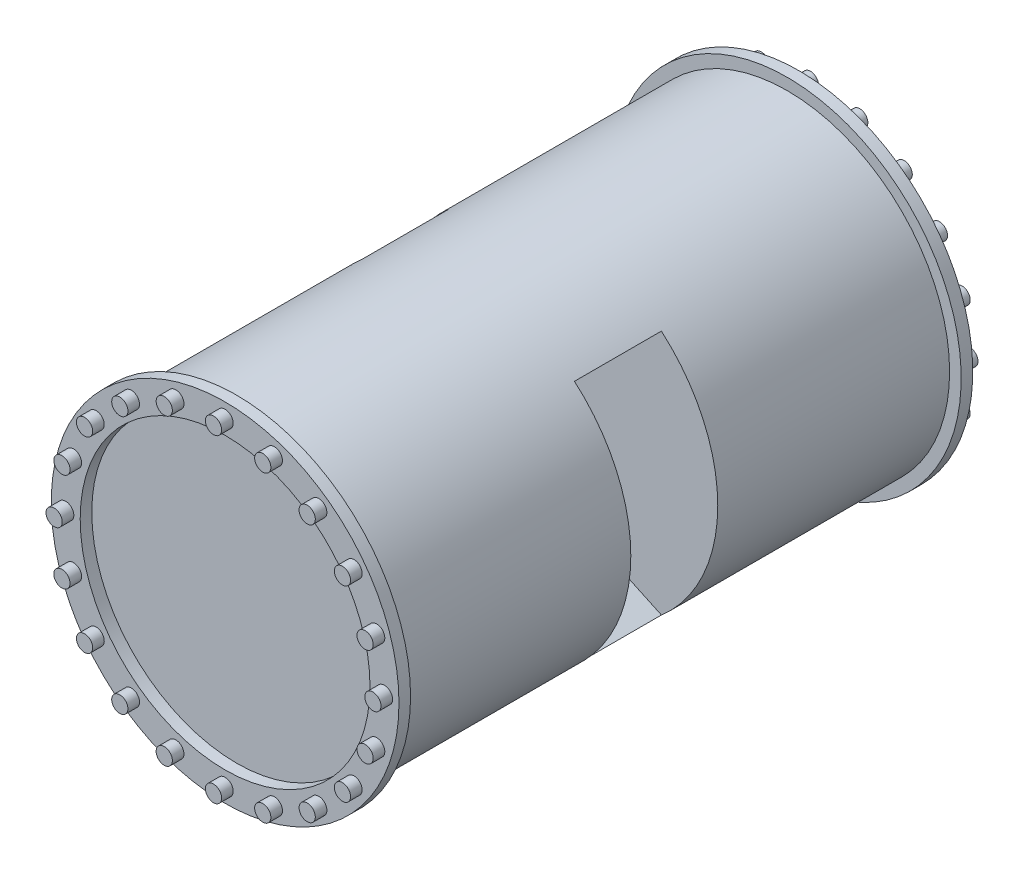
ISO-10303-21;
HEADER;
FILE_DESCRIPTION(('STEP AP214'),'2;1');
FILE_NAME('part.step','',(''),(''),'','','');
FILE_SCHEMA(('AUTOMOTIVE_DESIGN { 1 0 10303 214 1 1 1 1 }'));
ENDSEC;
DATA;
#1=APPLICATION_CONTEXT('core data for automotive mechanical design processes');
#2=APPLICATION_PROTOCOL_DEFINITION('international standard','automotive_design',2000,#1);
#3=PRODUCT_CONTEXT('',#1,'mechanical');
#4=PRODUCT('Part','Part','',(#3));
#5=PRODUCT_RELATED_PRODUCT_CATEGORY('part','',(#4));
#6=PRODUCT_DEFINITION_FORMATION('','',#4);
#7=PRODUCT_DEFINITION_CONTEXT('part definition',#1,'design');
#8=PRODUCT_DEFINITION('design','',#6,#7);
#9=PRODUCT_DEFINITION_SHAPE('','',#8);
#10=(LENGTH_UNIT() NAMED_UNIT(*) SI_UNIT(.MILLI.,.METRE.));
#11=(NAMED_UNIT(*) PLANE_ANGLE_UNIT() SI_UNIT($,.RADIAN.));
#12=(NAMED_UNIT(*) SI_UNIT($,.STERADIAN.) SOLID_ANGLE_UNIT());
#13=UNCERTAINTY_MEASURE_WITH_UNIT(LENGTH_MEASURE(1.E-05),#10,'distance_accuracy_value','');
#14=(GEOMETRIC_REPRESENTATION_CONTEXT(3) GLOBAL_UNCERTAINTY_ASSIGNED_CONTEXT((#13)) GLOBAL_UNIT_ASSIGNED_CONTEXT((#10,
#11,#12)) REPRESENTATION_CONTEXT('',''));
#15=CARTESIAN_POINT('',(0.,0.,0.));
#16=DIRECTION('',(0.,0.,1.));
#17=DIRECTION('',(1.,0.,0.));
#18=AXIS2_PLACEMENT_3D('',#15,#16,#17);
#19=CARTESIAN_POINT('',(0.,0.,-200.));
#20=DIRECTION('',(0.,0.,-1.));
#21=DIRECTION('',(-1.,0.,0.));
#22=AXIS2_PLACEMENT_3D('',#19,#20,#21);
#23=PLANE('',#22);
#24=CARTESIAN_POINT('',(0.,0.,-200.));
#25=DIRECTION('',(0.,0.,-1.));
#26=DIRECTION('',(-1.,0.,0.));
#27=AXIS2_PLACEMENT_3D('',#24,#25,#26);
#28=CIRCLE('',#27,20.);
#29=CARTESIAN_POINT('',(-20.,0.,-200.));
#30=VERTEX_POINT('',#29);
#31=EDGE_CURVE('E140',#30,#30,#28,.T.);
#32=ORIENTED_EDGE('',*,*,#31,.F.);
#33=EDGE_LOOP('',(#32));
#34=FACE_BOUND('',#33,.T.);
#35=CARTESIAN_POINT('',(0.,0.,-200.));
#36=DIRECTION('',(0.,0.,-1.));
#37=DIRECTION('',(-1.,0.,0.));
#38=AXIS2_PLACEMENT_3D('',#35,#36,#37);
#39=CIRCLE('',#38,140.);
#40=CARTESIAN_POINT('',(91.3830553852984,106.061949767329,-200.));
#41=VERTEX_POINT('',#40);
#42=CARTESIAN_POINT('',(91.3830553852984,-106.061949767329,-200.));
#43=VERTEX_POINT('',#42);
#44=EDGE_CURVE('E115',#41,#43,#39,.T.);
#45=ORIENTED_EDGE('',*,*,#44,.T.);
#46=DIRECTION('',(0.906307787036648,-0.422618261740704,0.));
#47=VECTOR('',#46,1.);
#48=CARTESIAN_POINT('',(6.33927392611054,-66.4053831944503,-200.));
#49=LINE('',#48,#47);
#50=CARTESIAN_POINT('',(6.33927392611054,-66.4053831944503,-200.));
#51=VERTEX_POINT('',#50);
#52=EDGE_CURVE('E1765',#51,#43,#49,.T.);
#53=ORIENTED_EDGE('',*,*,#52,.F.);
#54=CARTESIAN_POINT('',(0.,-80.,-200.));
#55=DIRECTION('',(0.,0.,-1.));
#56=DIRECTION('',(-1.,0.,0.));
#57=AXIS2_PLACEMENT_3D('',#54,#55,#56);
#58=CIRCLE('',#57,15.);
#59=CARTESIAN_POINT('',(-6.33927392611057,-66.4053831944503,-200.));
#60=VERTEX_POINT('',#59);
#61=EDGE_CURVE('E1768',#60,#51,#58,.T.);
#62=ORIENTED_EDGE('',*,*,#61,.F.);
#63=DIRECTION('',(0.906307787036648,0.422618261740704,0.));
#64=VECTOR('',#63,1.);
#65=CARTESIAN_POINT('',(-6.33927392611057,-66.4053831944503,-200.));
#66=LINE('',#65,#64);
#67=CARTESIAN_POINT('',(-91.3830553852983,-106.061949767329,-200.));
#68=VERTEX_POINT('',#67);
#69=EDGE_CURVE('E1763',#68,#60,#66,.T.);
#70=ORIENTED_EDGE('',*,*,#69,.F.);
#71=CARTESIAN_POINT('',(-91.3830553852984,106.061949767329,-200.));
#72=VERTEX_POINT('',#71);
#73=EDGE_CURVE('E135',#68,#72,#39,.T.);
#74=ORIENTED_EDGE('',*,*,#73,.T.);
#75=DIRECTION('',(-0.906307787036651,0.422618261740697,0.));
#76=VECTOR('',#75,1.);
#77=CARTESIAN_POINT('',(-6.33927392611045,66.4053831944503,-200.));
#78=LINE('',#77,#76);
#79=CARTESIAN_POINT('',(-6.33927392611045,66.4053831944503,-200.));
#80=VERTEX_POINT('',#79);
#81=EDGE_CURVE('E118',#80,#72,#78,.T.);
#82=ORIENTED_EDGE('',*,*,#81,.F.);
#83=CARTESIAN_POINT('',(0.,80.,-200.));
#84=DIRECTION('',(0.,0.,-1.));
#85=DIRECTION('',(-1.,0.,0.));
#86=AXIS2_PLACEMENT_3D('',#83,#84,#85);
#87=CIRCLE('',#86,15.);
#88=CARTESIAN_POINT('',(6.33927392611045,66.4053831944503,-200.));
#89=VERTEX_POINT('',#88);
#90=EDGE_CURVE('E117',#89,#80,#87,.T.);
#91=ORIENTED_EDGE('',*,*,#90,.F.);
#92=DIRECTION('',(-0.906307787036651,-0.422618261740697,0.));
#93=VECTOR('',#92,1.);
#94=CARTESIAN_POINT('',(6.33927392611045,66.4053831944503,-200.));
#95=LINE('',#94,#93);
#96=EDGE_CURVE('E66',#41,#89,#95,.T.);
#97=ORIENTED_EDGE('',*,*,#96,.F.);
#98=EDGE_LOOP('',(#45,#53,#62,#70,#74,#82,#91,#97));
#99=FACE_BOUND('',#98,.T.);
#100=ADVANCED_FACE('F42',(#34,#99),#23,.T.);
#101=CARTESIAN_POINT('',(0.,0.,10.));
#102=DIRECTION('',(0.,0.,1.));
#103=DIRECTION('',(1.,0.,0.));
#104=AXIS2_PLACEMENT_3D('',#101,#102,#103);
#105=PLANE('',#104);
#106=CARTESIAN_POINT('',(42.4898367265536,130.770270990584,10.));
#107=DIRECTION('',(0.,0.,1.));
#108=DIRECTION('',(0.951056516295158,-0.309016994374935,0.));
#109=AXIS2_PLACEMENT_3D('',#106,#107,#108);
#110=CIRCLE('',#109,7.);
#111=CARTESIAN_POINT('',(49.1472323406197,128.60715202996,10.));
#112=VERTEX_POINT('',#111);
#113=EDGE_CURVE('E134',#112,#112,#110,.T.);
#114=ORIENTED_EDGE('',*,*,#113,.F.);
#115=EDGE_LOOP('',(#114));
#116=FACE_BOUND('',#115,.T.);
#117=CARTESIAN_POINT('',(80.8204721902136,111.239836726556,10.));
#118=DIRECTION('',(0.,0.,1.));
#119=DIRECTION('',(0.809016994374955,-0.587785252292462,0.));
#120=AXIS2_PLACEMENT_3D('',#117,#118,#119);
#121=CIRCLE('',#120,7.);
#122=CARTESIAN_POINT('',(86.4835911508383,107.125339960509,10.));
#123=VERTEX_POINT('',#122);
#124=EDGE_CURVE('E148',#123,#123,#121,.T.);
#125=ORIENTED_EDGE('',*,*,#124,.F.);
#126=EDGE_LOOP('',(#125));
#127=FACE_BOUND('',#126,.T.);
#128=CARTESIAN_POINT('',(111.239836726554,80.8204721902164,10.));
#129=DIRECTION('',(0.,0.,1.));
#130=DIRECTION('',(0.587785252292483,-0.80901699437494,0.));
#131=AXIS2_PLACEMENT_3D('',#128,#129,#130);
#132=CIRCLE('',#131,7.);
#133=CARTESIAN_POINT('',(115.354333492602,75.1573532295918,10.));
#134=VERTEX_POINT('',#133);
#135=EDGE_CURVE('E153',#134,#134,#132,.T.);
#136=ORIENTED_EDGE('',*,*,#135,.F.);
#137=EDGE_LOOP('',(#136));
#138=FACE_BOUND('',#137,.T.);
#139=CARTESIAN_POINT('',(130.770270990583,42.4898367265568,10.));
#140=DIRECTION('',(0.,0.,1.));
#141=DIRECTION('',(0.309016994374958,-0.95105651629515,0.));
#142=AXIS2_PLACEMENT_3D('',#139,#140,#141);
#143=CIRCLE('',#142,7.);
#144=CARTESIAN_POINT('',(132.933389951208,35.8324411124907,10.));
#145=VERTEX_POINT('',#144);
#146=EDGE_CURVE('E159',#145,#145,#143,.T.);
#147=ORIENTED_EDGE('',*,*,#146,.F.);
#148=EDGE_LOOP('',(#147));
#149=FACE_BOUND('',#148,.T.);
#150=CARTESIAN_POINT('',(137.5,1.44023605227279E-12,10.));
#151=DIRECTION('',(0.,0.,1.));
#152=DIRECTION('',(0.,-1.,0.));
#153=AXIS2_PLACEMENT_3D('',#150,#151,#152);
#154=CIRCLE('',#153,7.);
#155=CARTESIAN_POINT('',(137.5,-6.99999999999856,10.));
#156=VERTEX_POINT('',#155);
#157=EDGE_CURVE('E165',#156,#156,#154,.T.);
#158=ORIENTED_EDGE('',*,*,#157,.F.);
#159=EDGE_LOOP('',(#158));
#160=FACE_BOUND('',#159,.T.);
#161=CARTESIAN_POINT('',(130.770270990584,-42.489836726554,10.));
#162=DIRECTION('',(0.,0.,1.));
#163=DIRECTION('',(-0.309016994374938,-0.951056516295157,0.));
#164=AXIS2_PLACEMENT_3D('',#161,#162,#163);
#165=CIRCLE('',#164,7.);
#166=CARTESIAN_POINT('',(128.607152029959,-49.1472323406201,10.));
#167=VERTEX_POINT('',#166);
#168=EDGE_CURVE('E171',#167,#167,#165,.T.);
#169=ORIENTED_EDGE('',*,*,#168,.F.);
#170=EDGE_LOOP('',(#169));
#171=FACE_BOUND('',#170,.T.);
#172=CARTESIAN_POINT('',(111.239836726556,-80.820472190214,10.));
#173=DIRECTION('',(0.,0.,1.));
#174=DIRECTION('',(-0.587785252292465,-0.809016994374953,0.));
#175=AXIS2_PLACEMENT_3D('',#172,#173,#174);
#176=CIRCLE('',#175,7.);
#177=CARTESIAN_POINT('',(107.125339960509,-86.4835911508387,10.));
#178=VERTEX_POINT('',#177);
#179=EDGE_CURVE('E177',#178,#178,#176,.T.);
#180=ORIENTED_EDGE('',*,*,#179,.F.);
#181=EDGE_LOOP('',(#180));
#182=FACE_BOUND('',#181,.T.);
#183=CARTESIAN_POINT('',(80.820472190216,-111.239836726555,10.));
#184=DIRECTION('',(0.,0.,1.));
#185=DIRECTION('',(-0.809016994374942,-0.58778525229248,0.));
#186=AXIS2_PLACEMENT_3D('',#183,#184,#185);
#187=CIRCLE('',#186,7.);
#188=CARTESIAN_POINT('',(75.1573532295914,-115.354333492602,10.));
#189=VERTEX_POINT('',#188);
#190=EDGE_CURVE('E183',#189,#189,#187,.T.);
#191=ORIENTED_EDGE('',*,*,#190,.F.);
#192=EDGE_LOOP('',(#191));
#193=FACE_BOUND('',#192,.T.);
#194=CARTESIAN_POINT('',(42.4898367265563,-130.770270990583,10.));
#195=DIRECTION('',(0.,0.,1.));
#196=DIRECTION('',(-0.951056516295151,-0.309016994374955,0.));
#197=AXIS2_PLACEMENT_3D('',#194,#195,#196);
#198=CIRCLE('',#197,7.);
#199=CARTESIAN_POINT('',(35.8324411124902,-132.933389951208,10.));
#200=VERTEX_POINT('',#199);
#201=EDGE_CURVE('E189',#200,#200,#198,.T.);
#202=ORIENTED_EDGE('',*,*,#201,.F.);
#203=EDGE_LOOP('',(#202));
#204=FACE_BOUND('',#203,.T.);
#205=CARTESIAN_POINT('',(0.,-137.5,10.));
#206=DIRECTION('',(0.,0.,1.));
#207=DIRECTION('',(-1.,0.,0.));
#208=AXIS2_PLACEMENT_3D('',#205,#206,#207);
#209=CIRCLE('',#208,7.);
#210=CARTESIAN_POINT('',(-7.,-137.5,10.));
#211=VERTEX_POINT('',#210);
#212=EDGE_CURVE('E195',#211,#211,#209,.T.);
#213=ORIENTED_EDGE('',*,*,#212,.F.);
#214=EDGE_LOOP('',(#213));
#215=FACE_BOUND('',#214,.T.);
#216=CARTESIAN_POINT('',(-42.4898367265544,-130.770270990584,10.));
#217=DIRECTION('',(0.,0.,1.));
#218=DIRECTION('',(-0.951056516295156,0.309016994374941,0.));
#219=AXIS2_PLACEMENT_3D('',#216,#217,#218);
#220=CIRCLE('',#219,7.);
#221=CARTESIAN_POINT('',(-49.1472323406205,-128.607152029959,10.));
#222=VERTEX_POINT('',#221);
#223=EDGE_CURVE('E201',#222,#222,#220,.T.);
#224=ORIENTED_EDGE('',*,*,#223,.F.);
#225=EDGE_LOOP('',(#224));
#226=FACE_BOUND('',#225,.T.);
#227=CARTESIAN_POINT('',(-80.8204721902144,-111.239836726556,10.));
#228=DIRECTION('',(0.,0.,1.));
#229=DIRECTION('',(-0.809016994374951,0.587785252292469,0.));
#230=AXIS2_PLACEMENT_3D('',#227,#228,#229);
#231=CIRCLE('',#230,7.);
#232=CARTESIAN_POINT('',(-86.4835911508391,-107.125339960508,10.));
#233=VERTEX_POINT('',#232);
#234=EDGE_CURVE('E207',#233,#233,#231,.T.);
#235=ORIENTED_EDGE('',*,*,#234,.F.);
#236=EDGE_LOOP('',(#235));
#237=FACE_BOUND('',#236,.T.);
#238=CARTESIAN_POINT('',(-111.239836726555,-80.8204721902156,10.));
#239=DIRECTION('',(0.,0.,1.));
#240=DIRECTION('',(-0.587785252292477,0.809016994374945,0.));
#241=AXIS2_PLACEMENT_3D('',#238,#239,#240);
#242=CIRCLE('',#241,7.);
#243=CARTESIAN_POINT('',(-115.354333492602,-75.157353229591,10.));
#244=VERTEX_POINT('',#243);
#245=EDGE_CURVE('E213',#244,#244,#242,.T.);
#246=ORIENTED_EDGE('',*,*,#245,.F.);
#247=EDGE_LOOP('',(#246));
#248=FACE_BOUND('',#247,.T.);
#249=CARTESIAN_POINT('',(-130.770270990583,-42.4898367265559,10.));
#250=DIRECTION('',(0.,0.,1.));
#251=DIRECTION('',(-0.309016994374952,0.951056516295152,0.));
#252=AXIS2_PLACEMENT_3D('',#249,#250,#251);
#253=CIRCLE('',#252,7.);
#254=CARTESIAN_POINT('',(-132.933389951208,-35.8324411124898,10.));
#255=VERTEX_POINT('',#254);
#256=EDGE_CURVE('E219',#255,#255,#253,.T.);
#257=ORIENTED_EDGE('',*,*,#256,.F.);
#258=EDGE_LOOP('',(#257));
#259=FACE_BOUND('',#258,.T.);
#260=CARTESIAN_POINT('',(-137.5,-4.80078684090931E-13,10.));
#261=DIRECTION('',(0.,0.,1.));
#262=DIRECTION('',(0.,1.,0.));
#263=AXIS2_PLACEMENT_3D('',#260,#261,#262);
#264=CIRCLE('',#263,7.);
#265=CARTESIAN_POINT('',(-137.5,6.99999999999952,10.));
#266=VERTEX_POINT('',#265);
#267=EDGE_CURVE('E225',#266,#266,#264,.T.);
#268=ORIENTED_EDGE('',*,*,#267,.F.);
#269=EDGE_LOOP('',(#268));
#270=FACE_BOUND('',#269,.T.);
#271=CARTESIAN_POINT('',(-130.770270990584,42.4898367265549,10.));
#272=DIRECTION('',(0.,0.,1.));
#273=DIRECTION('',(0.309016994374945,0.951056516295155,0.));
#274=AXIS2_PLACEMENT_3D('',#271,#272,#273);
#275=CIRCLE('',#274,7.);
#276=CARTESIAN_POINT('',(-128.607152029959,49.147232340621,10.));
#277=VERTEX_POINT('',#276);
#278=EDGE_CURVE('E231',#277,#277,#275,.T.);
#279=ORIENTED_EDGE('',*,*,#278,.F.);
#280=EDGE_LOOP('',(#279));
#281=FACE_BOUND('',#280,.T.);
#282=CARTESIAN_POINT('',(-111.239836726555,80.8204721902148,10.));
#283=DIRECTION('',(0.,0.,1.));
#284=DIRECTION('',(0.587785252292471,0.809016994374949,0.));
#285=AXIS2_PLACEMENT_3D('',#282,#283,#284);
#286=CIRCLE('',#285,7.);
#287=CARTESIAN_POINT('',(-107.125339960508,86.4835911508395,10.));
#288=VERTEX_POINT('',#287);
#289=EDGE_CURVE('E237',#288,#288,#286,.T.);
#290=ORIENTED_EDGE('',*,*,#289,.F.);
#291=EDGE_LOOP('',(#290));
#292=FACE_BOUND('',#291,.T.);
#293=CARTESIAN_POINT('',(-80.8204721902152,111.239836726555,10.));
#294=DIRECTION('',(0.,0.,1.));
#295=DIRECTION('',(0.809016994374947,0.587785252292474,0.));
#296=AXIS2_PLACEMENT_3D('',#293,#294,#295);
#297=CIRCLE('',#296,7.);
#298=CARTESIAN_POINT('',(-75.1573532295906,115.354333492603,10.));
#299=VERTEX_POINT('',#298);
#300=EDGE_CURVE('E243',#299,#299,#297,.T.);
#301=ORIENTED_EDGE('',*,*,#300,.F.);
#302=EDGE_LOOP('',(#301));
#303=FACE_BOUND('',#302,.T.);
#304=CARTESIAN_POINT('',(-42.4898367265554,130.770270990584,10.));
#305=DIRECTION('',(0.,0.,1.));
#306=DIRECTION('',(0.951056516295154,0.309016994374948,0.));
#307=AXIS2_PLACEMENT_3D('',#304,#305,#306);
#308=CIRCLE('',#307,7.);
#309=CARTESIAN_POINT('',(-35.8324411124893,132.933389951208,10.));
#310=VERTEX_POINT('',#309);
#311=EDGE_CURVE('E249',#310,#310,#308,.T.);
#312=ORIENTED_EDGE('',*,*,#311,.F.);
#313=EDGE_LOOP('',(#312));
#314=FACE_BOUND('',#313,.T.);
#315=CARTESIAN_POINT('',(0.,137.5,10.));
#316=DIRECTION('',(0.,0.,1.));
#317=DIRECTION('',(1.,0.,0.));
#318=AXIS2_PLACEMENT_3D('',#315,#316,#317);
#319=CIRCLE('',#318,7.);
#320=CARTESIAN_POINT('',(7.,137.5,10.));
#321=VERTEX_POINT('',#320);
#322=EDGE_CURVE('E255',#321,#321,#319,.T.);
#323=ORIENTED_EDGE('',*,*,#322,.F.);
#324=EDGE_LOOP('',(#323));
#325=FACE_BOUND('',#324,.T.);
#326=CARTESIAN_POINT('',(0.,0.,10.));
#327=DIRECTION('',(0.,0.,1.));
#328=DIRECTION('',(1.,0.,0.));
#329=AXIS2_PLACEMENT_3D('',#326,#327,#328);
#330=CIRCLE('',#329,150.);
#331=CARTESIAN_POINT('',(150.,0.,10.));
#332=VERTEX_POINT('',#331);
#333=EDGE_CURVE('E146',#332,#332,#330,.T.);
#334=ORIENTED_EDGE('',*,*,#333,.T.);
#335=EDGE_LOOP('',(#334));
#336=FACE_BOUND('',#335,.T.);
#337=CARTESIAN_POINT('',(0.,0.,10.));
#338=DIRECTION('',(0.,0.,1.));
#339=DIRECTION('',(1.,0.,0.));
#340=AXIS2_PLACEMENT_3D('',#337,#338,#339);
#341=CIRCLE('',#340,125.);
#342=CARTESIAN_POINT('',(125.,0.,10.));
#343=VERTEX_POINT('',#342);
#344=EDGE_CURVE('E264',#343,#343,#341,.T.);
#345=ORIENTED_EDGE('',*,*,#344,.F.);
#346=EDGE_LOOP('',(#345));
#347=FACE_BOUND('',#346,.T.);
#348=ADVANCED_FACE('F277',(#116,#127,#138,#149,#160,#171,#182,#193,#204,#215,#226,#237,#248,
#259,#270,#281,#292,#303,#314,#325,#336,#347),#105,.T.);
#349=CARTESIAN_POINT('',(0.,0.,0.));
#350=DIRECTION('',(0.,0.,1.));
#351=DIRECTION('',(1.,0.,0.));
#352=AXIS2_PLACEMENT_3D('',#349,#350,#351);
#353=PLANE('',#352);
#354=CARTESIAN_POINT('',(0.,0.,0.));
#355=DIRECTION('',(0.,0.,-1.));
#356=DIRECTION('',(-1.,0.,0.));
#357=AXIS2_PLACEMENT_3D('',#354,#355,#356);
#358=CIRCLE('',#357,140.);
#359=CARTESIAN_POINT('',(-140.,0.,0.));
#360=VERTEX_POINT('',#359);
#361=EDGE_CURVE('E50',#360,#360,#358,.T.);
#362=ORIENTED_EDGE('',*,*,#361,.F.);
#363=EDGE_LOOP('',(#362));
#364=FACE_BOUND('',#363,.T.);
#365=CARTESIAN_POINT('',(0.,0.,0.));
#366=DIRECTION('',(0.,0.,1.));
#367=DIRECTION('',(1.,0.,0.));
#368=AXIS2_PLACEMENT_3D('',#365,#366,#367);
#369=CIRCLE('',#368,150.);
#370=CARTESIAN_POINT('',(150.,0.,0.));
#371=VERTEX_POINT('',#370);
#372=EDGE_CURVE('E267',#371,#371,#369,.T.);
#373=ORIENTED_EDGE('',*,*,#372,.F.);
#374=EDGE_LOOP('',(#373));
#375=FACE_BOUND('',#374,.T.);
#376=ADVANCED_FACE('F275',(#364,#375),#353,.F.);
#377=CARTESIAN_POINT('',(0.,0.,10.));
#378=DIRECTION('',(0.,0.,-1.));
#379=DIRECTION('',(-1.,0.,0.));
#380=AXIS2_PLACEMENT_3D('',#377,#378,#379);
#381=CYLINDRICAL_SURFACE('',#380,150.);
#382=ORIENTED_EDGE('',*,*,#333,.F.);
#383=EDGE_LOOP('',(#382));
#384=FACE_BOUND('',#383,.T.);
#385=ORIENTED_EDGE('',*,*,#372,.T.);
#386=EDGE_LOOP('',(#385));
#387=FACE_BOUND('',#386,.T.);
#388=ADVANCED_FACE('F44',(#384,#387),#381,.T.);
#389=CARTESIAN_POINT('',(0.,0.,10.));
#390=DIRECTION('',(0.,0.,-1.));
#391=DIRECTION('',(-1.,0.,0.));
#392=AXIS2_PLACEMENT_3D('',#389,#390,#391);
#393=CYLINDRICAL_SURFACE('',#392,125.);
#394=ORIENTED_EDGE('',*,*,#344,.T.);
#395=EDGE_LOOP('',(#394));
#396=FACE_BOUND('',#395,.T.);
#397=CARTESIAN_POINT('',(0.,0.,0.));
#398=DIRECTION('',(0.,0.,1.));
#399=DIRECTION('',(1.,0.,0.));
#400=AXIS2_PLACEMENT_3D('',#397,#398,#399);
#401=CIRCLE('',#400,125.);
#402=CARTESIAN_POINT('',(125.,0.,0.));
#403=VERTEX_POINT('',#402);
#404=EDGE_CURVE('E261',#403,#403,#401,.T.);
#405=ORIENTED_EDGE('',*,*,#404,.F.);
#406=EDGE_LOOP('',(#405));
#407=FACE_BOUND('',#406,.T.);
#408=ADVANCED_FACE('F283',(#396,#407),#393,.F.);
#409=CARTESIAN_POINT('',(0.,137.5,20.));
#410=DIRECTION('',(0.,0.,-1.));
#411=DIRECTION('',(-1.,0.,0.));
#412=AXIS2_PLACEMENT_3D('',#409,#410,#411);
#413=CYLINDRICAL_SURFACE('',#412,7.);
#414=CARTESIAN_POINT('',(0.,137.5,20.));
#415=DIRECTION('',(0.,0.,1.));
#416=DIRECTION('',(1.,0.,0.));
#417=AXIS2_PLACEMENT_3D('',#414,#415,#416);
#418=CIRCLE('',#417,7.);
#419=CARTESIAN_POINT('',(7.,137.5,20.));
#420=VERTEX_POINT('',#419);
#421=EDGE_CURVE('E258',#420,#420,#418,.T.);
#422=ORIENTED_EDGE('',*,*,#421,.F.);
#423=EDGE_LOOP('',(#422));
#424=FACE_BOUND('',#423,.T.);
#425=ORIENTED_EDGE('',*,*,#322,.T.);
#426=EDGE_LOOP('',(#425));
#427=FACE_BOUND('',#426,.T.);
#428=ADVANCED_FACE('F459',(#424,#427),#413,.T.);
#429=CARTESIAN_POINT('',(0.,0.,20.));
#430=DIRECTION('',(0.,0.,1.));
#431=DIRECTION('',(1.,0.,0.));
#432=AXIS2_PLACEMENT_3D('',#429,#430,#431);
#433=PLANE('',#432);
#434=ORIENTED_EDGE('',*,*,#421,.T.);
#435=EDGE_LOOP('',(#434));
#436=FACE_BOUND('',#435,.T.);
#437=ADVANCED_FACE('F455',(#436),#433,.T.);
#438=CARTESIAN_POINT('',(-42.4898367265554,130.770270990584,20.));
#439=DIRECTION('',(0.,0.,-1.));
#440=DIRECTION('',(-1.,0.,0.));
#441=AXIS2_PLACEMENT_3D('',#438,#439,#440);
#442=CYLINDRICAL_SURFACE('',#441,7.);
#443=CARTESIAN_POINT('',(-42.4898367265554,130.770270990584,20.));
#444=DIRECTION('',(0.,0.,1.));
#445=DIRECTION('',(0.951056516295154,0.309016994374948,0.));
#446=AXIS2_PLACEMENT_3D('',#443,#444,#445);
#447=CIRCLE('',#446,7.);
#448=CARTESIAN_POINT('',(-35.8324411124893,132.933389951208,20.));
#449=VERTEX_POINT('',#448);
#450=EDGE_CURVE('E252',#449,#449,#447,.T.);
#451=ORIENTED_EDGE('',*,*,#450,.F.);
#452=EDGE_LOOP('',(#451));
#453=FACE_BOUND('',#452,.T.);
#454=ORIENTED_EDGE('',*,*,#311,.T.);
#455=EDGE_LOOP('',(#454));
#456=FACE_BOUND('',#455,.T.);
#457=ADVANCED_FACE('F451',(#453,#456),#442,.T.);
#458=CARTESIAN_POINT('',(0.,0.,20.));
#459=DIRECTION('',(0.,0.,1.));
#460=DIRECTION('',(0.951056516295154,0.309016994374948,0.));
#461=AXIS2_PLACEMENT_3D('',#458,#459,#460);
#462=PLANE('',#461);
#463=ORIENTED_EDGE('',*,*,#450,.T.);
#464=EDGE_LOOP('',(#463));
#465=FACE_BOUND('',#464,.T.);
#466=ADVANCED_FACE('F447',(#465),#462,.T.);
#467=CARTESIAN_POINT('',(-80.8204721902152,111.239836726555,20.));
#468=DIRECTION('',(0.,0.,-1.));
#469=DIRECTION('',(-1.,0.,0.));
#470=AXIS2_PLACEMENT_3D('',#467,#468,#469);
#471=CYLINDRICAL_SURFACE('',#470,7.);
#472=CARTESIAN_POINT('',(-80.8204721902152,111.239836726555,20.));
#473=DIRECTION('',(0.,0.,1.));
#474=DIRECTION('',(0.809016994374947,0.587785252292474,0.));
#475=AXIS2_PLACEMENT_3D('',#472,#473,#474);
#476=CIRCLE('',#475,7.);
#477=CARTESIAN_POINT('',(-75.1573532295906,115.354333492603,20.));
#478=VERTEX_POINT('',#477);
#479=EDGE_CURVE('E246',#478,#478,#476,.T.);
#480=ORIENTED_EDGE('',*,*,#479,.F.);
#481=EDGE_LOOP('',(#480));
#482=FACE_BOUND('',#481,.T.);
#483=ORIENTED_EDGE('',*,*,#300,.T.);
#484=EDGE_LOOP('',(#483));
#485=FACE_BOUND('',#484,.T.);
#486=ADVANCED_FACE('F443',(#482,#485),#471,.T.);
#487=CARTESIAN_POINT('',(0.,0.,20.));
#488=DIRECTION('',(0.,0.,1.));
#489=DIRECTION('',(0.809016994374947,0.587785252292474,0.));
#490=AXIS2_PLACEMENT_3D('',#487,#488,#489);
#491=PLANE('',#490);
#492=ORIENTED_EDGE('',*,*,#479,.T.);
#493=EDGE_LOOP('',(#492));
#494=FACE_BOUND('',#493,.T.);
#495=ADVANCED_FACE('F439',(#494),#491,.T.);
#496=CARTESIAN_POINT('',(-111.239836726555,80.8204721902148,20.));
#497=DIRECTION('',(0.,0.,-1.));
#498=DIRECTION('',(-1.,0.,0.));
#499=AXIS2_PLACEMENT_3D('',#496,#497,#498);
#500=CYLINDRICAL_SURFACE('',#499,7.);
#501=CARTESIAN_POINT('',(-111.239836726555,80.8204721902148,20.));
#502=DIRECTION('',(0.,0.,1.));
#503=DIRECTION('',(0.587785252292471,0.809016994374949,0.));
#504=AXIS2_PLACEMENT_3D('',#501,#502,#503);
#505=CIRCLE('',#504,7.);
#506=CARTESIAN_POINT('',(-107.125339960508,86.4835911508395,20.));
#507=VERTEX_POINT('',#506);
#508=EDGE_CURVE('E240',#507,#507,#505,.T.);
#509=ORIENTED_EDGE('',*,*,#508,.F.);
#510=EDGE_LOOP('',(#509));
#511=FACE_BOUND('',#510,.T.);
#512=ORIENTED_EDGE('',*,*,#289,.T.);
#513=EDGE_LOOP('',(#512));
#514=FACE_BOUND('',#513,.T.);
#515=ADVANCED_FACE('F435',(#511,#514),#500,.T.);
#516=CARTESIAN_POINT('',(0.,0.,20.));
#517=DIRECTION('',(0.,0.,1.));
#518=DIRECTION('',(0.587785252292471,0.809016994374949,0.));
#519=AXIS2_PLACEMENT_3D('',#516,#517,#518);
#520=PLANE('',#519);
#521=ORIENTED_EDGE('',*,*,#508,.T.);
#522=EDGE_LOOP('',(#521));
#523=FACE_BOUND('',#522,.T.);
#524=ADVANCED_FACE('F431',(#523),#520,.T.);
#525=CARTESIAN_POINT('',(-130.770270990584,42.4898367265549,20.));
#526=DIRECTION('',(0.,0.,-1.));
#527=DIRECTION('',(-1.,0.,0.));
#528=AXIS2_PLACEMENT_3D('',#525,#526,#527);
#529=CYLINDRICAL_SURFACE('',#528,7.);
#530=CARTESIAN_POINT('',(-130.770270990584,42.4898367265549,20.));
#531=DIRECTION('',(0.,0.,1.));
#532=DIRECTION('',(0.309016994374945,0.951056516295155,0.));
#533=AXIS2_PLACEMENT_3D('',#530,#531,#532);
#534=CIRCLE('',#533,7.);
#535=CARTESIAN_POINT('',(-128.607152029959,49.147232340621,20.));
#536=VERTEX_POINT('',#535);
#537=EDGE_CURVE('E234',#536,#536,#534,.T.);
#538=ORIENTED_EDGE('',*,*,#537,.F.);
#539=EDGE_LOOP('',(#538));
#540=FACE_BOUND('',#539,.T.);
#541=ORIENTED_EDGE('',*,*,#278,.T.);
#542=EDGE_LOOP('',(#541));
#543=FACE_BOUND('',#542,.T.);
#544=ADVANCED_FACE('F427',(#540,#543),#529,.T.);
#545=CARTESIAN_POINT('',(0.,0.,20.));
#546=DIRECTION('',(0.,0.,1.));
#547=DIRECTION('',(0.309016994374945,0.951056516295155,0.));
#548=AXIS2_PLACEMENT_3D('',#545,#546,#547);
#549=PLANE('',#548);
#550=ORIENTED_EDGE('',*,*,#537,.T.);
#551=EDGE_LOOP('',(#550));
#552=FACE_BOUND('',#551,.T.);
#553=ADVANCED_FACE('F423',(#552),#549,.T.);
#554=CARTESIAN_POINT('',(-137.5,-4.80078684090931E-13,20.));
#555=DIRECTION('',(0.,0.,-1.));
#556=DIRECTION('',(-1.,0.,0.));
#557=AXIS2_PLACEMENT_3D('',#554,#555,#556);
#558=CYLINDRICAL_SURFACE('',#557,7.);
#559=CARTESIAN_POINT('',(-137.5,-4.80078684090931E-13,20.));
#560=DIRECTION('',(0.,0.,1.));
#561=DIRECTION('',(0.,1.,0.));
#562=AXIS2_PLACEMENT_3D('',#559,#560,#561);
#563=CIRCLE('',#562,7.);
#564=CARTESIAN_POINT('',(-137.5,6.99999999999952,20.));
#565=VERTEX_POINT('',#564);
#566=EDGE_CURVE('E228',#565,#565,#563,.T.);
#567=ORIENTED_EDGE('',*,*,#566,.F.);
#568=EDGE_LOOP('',(#567));
#569=FACE_BOUND('',#568,.T.);
#570=ORIENTED_EDGE('',*,*,#267,.T.);
#571=EDGE_LOOP('',(#570));
#572=FACE_BOUND('',#571,.T.);
#573=ADVANCED_FACE('F419',(#569,#572),#558,.T.);
#574=CARTESIAN_POINT('',(0.,0.,20.));
#575=DIRECTION('',(0.,0.,1.));
#576=DIRECTION('',(0.,1.,0.));
#577=AXIS2_PLACEMENT_3D('',#574,#575,#576);
#578=PLANE('',#577);
#579=ORIENTED_EDGE('',*,*,#566,.T.);
#580=EDGE_LOOP('',(#579));
#581=FACE_BOUND('',#580,.T.);
#582=ADVANCED_FACE('F415',(#581),#578,.T.);
#583=CARTESIAN_POINT('',(-130.770270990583,-42.4898367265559,20.));
#584=DIRECTION('',(0.,0.,-1.));
#585=DIRECTION('',(-1.,0.,0.));
#586=AXIS2_PLACEMENT_3D('',#583,#584,#585);
#587=CYLINDRICAL_SURFACE('',#586,7.);
#588=CARTESIAN_POINT('',(-130.770270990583,-42.4898367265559,20.));
#589=DIRECTION('',(0.,0.,1.));
#590=DIRECTION('',(-0.309016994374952,0.951056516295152,0.));
#591=AXIS2_PLACEMENT_3D('',#588,#589,#590);
#592=CIRCLE('',#591,7.);
#593=CARTESIAN_POINT('',(-132.933389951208,-35.8324411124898,20.));
#594=VERTEX_POINT('',#593);
#595=EDGE_CURVE('E222',#594,#594,#592,.T.);
#596=ORIENTED_EDGE('',*,*,#595,.F.);
#597=EDGE_LOOP('',(#596));
#598=FACE_BOUND('',#597,.T.);
#599=ORIENTED_EDGE('',*,*,#256,.T.);
#600=EDGE_LOOP('',(#599));
#601=FACE_BOUND('',#600,.T.);
#602=ADVANCED_FACE('F411',(#598,#601),#587,.T.);
#603=CARTESIAN_POINT('',(0.,0.,20.));
#604=DIRECTION('',(0.,0.,1.));
#605=DIRECTION('',(-0.309016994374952,0.951056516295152,0.));
#606=AXIS2_PLACEMENT_3D('',#603,#604,#605);
#607=PLANE('',#606);
#608=ORIENTED_EDGE('',*,*,#595,.T.);
#609=EDGE_LOOP('',(#608));
#610=FACE_BOUND('',#609,.T.);
#611=ADVANCED_FACE('F407',(#610),#607,.T.);
#612=CARTESIAN_POINT('',(-111.239836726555,-80.8204721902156,20.));
#613=DIRECTION('',(0.,0.,-1.));
#614=DIRECTION('',(-1.,0.,0.));
#615=AXIS2_PLACEMENT_3D('',#612,#613,#614);
#616=CYLINDRICAL_SURFACE('',#615,7.);
#617=CARTESIAN_POINT('',(-111.239836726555,-80.8204721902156,20.));
#618=DIRECTION('',(0.,0.,1.));
#619=DIRECTION('',(-0.587785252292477,0.809016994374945,0.));
#620=AXIS2_PLACEMENT_3D('',#617,#618,#619);
#621=CIRCLE('',#620,7.);
#622=CARTESIAN_POINT('',(-115.354333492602,-75.157353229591,20.));
#623=VERTEX_POINT('',#622);
#624=EDGE_CURVE('E216',#623,#623,#621,.T.);
#625=ORIENTED_EDGE('',*,*,#624,.F.);
#626=EDGE_LOOP('',(#625));
#627=FACE_BOUND('',#626,.T.);
#628=ORIENTED_EDGE('',*,*,#245,.T.);
#629=EDGE_LOOP('',(#628));
#630=FACE_BOUND('',#629,.T.);
#631=ADVANCED_FACE('F403',(#627,#630),#616,.T.);
#632=CARTESIAN_POINT('',(0.,0.,20.));
#633=DIRECTION('',(0.,0.,1.));
#634=DIRECTION('',(-0.587785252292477,0.809016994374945,0.));
#635=AXIS2_PLACEMENT_3D('',#632,#633,#634);
#636=PLANE('',#635);
#637=ORIENTED_EDGE('',*,*,#624,.T.);
#638=EDGE_LOOP('',(#637));
#639=FACE_BOUND('',#638,.T.);
#640=ADVANCED_FACE('F399',(#639),#636,.T.);
#641=CARTESIAN_POINT('',(-80.8204721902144,-111.239836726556,20.));
#642=DIRECTION('',(0.,0.,-1.));
#643=DIRECTION('',(-1.,0.,0.));
#644=AXIS2_PLACEMENT_3D('',#641,#642,#643);
#645=CYLINDRICAL_SURFACE('',#644,7.);
#646=CARTESIAN_POINT('',(-80.8204721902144,-111.239836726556,20.));
#647=DIRECTION('',(0.,0.,1.));
#648=DIRECTION('',(-0.809016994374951,0.587785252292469,0.));
#649=AXIS2_PLACEMENT_3D('',#646,#647,#648);
#650=CIRCLE('',#649,7.);
#651=CARTESIAN_POINT('',(-86.4835911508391,-107.125339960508,20.));
#652=VERTEX_POINT('',#651);
#653=EDGE_CURVE('E210',#652,#652,#650,.T.);
#654=ORIENTED_EDGE('',*,*,#653,.F.);
#655=EDGE_LOOP('',(#654));
#656=FACE_BOUND('',#655,.T.);
#657=ORIENTED_EDGE('',*,*,#234,.T.);
#658=EDGE_LOOP('',(#657));
#659=FACE_BOUND('',#658,.T.);
#660=ADVANCED_FACE('F395',(#656,#659),#645,.T.);
#661=CARTESIAN_POINT('',(0.,0.,20.));
#662=DIRECTION('',(0.,0.,1.));
#663=DIRECTION('',(-0.809016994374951,0.587785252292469,0.));
#664=AXIS2_PLACEMENT_3D('',#661,#662,#663);
#665=PLANE('',#664);
#666=ORIENTED_EDGE('',*,*,#653,.T.);
#667=EDGE_LOOP('',(#666));
#668=FACE_BOUND('',#667,.T.);
#669=ADVANCED_FACE('F391',(#668),#665,.T.);
#670=CARTESIAN_POINT('',(-42.4898367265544,-130.770270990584,20.));
#671=DIRECTION('',(0.,0.,-1.));
#672=DIRECTION('',(-1.,0.,0.));
#673=AXIS2_PLACEMENT_3D('',#670,#671,#672);
#674=CYLINDRICAL_SURFACE('',#673,7.);
#675=CARTESIAN_POINT('',(-42.4898367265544,-130.770270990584,20.));
#676=DIRECTION('',(0.,0.,1.));
#677=DIRECTION('',(-0.951056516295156,0.309016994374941,0.));
#678=AXIS2_PLACEMENT_3D('',#675,#676,#677);
#679=CIRCLE('',#678,7.);
#680=CARTESIAN_POINT('',(-49.1472323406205,-128.607152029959,20.));
#681=VERTEX_POINT('',#680);
#682=EDGE_CURVE('E204',#681,#681,#679,.T.);
#683=ORIENTED_EDGE('',*,*,#682,.F.);
#684=EDGE_LOOP('',(#683));
#685=FACE_BOUND('',#684,.T.);
#686=ORIENTED_EDGE('',*,*,#223,.T.);
#687=EDGE_LOOP('',(#686));
#688=FACE_BOUND('',#687,.T.);
#689=ADVANCED_FACE('F387',(#685,#688),#674,.T.);
#690=CARTESIAN_POINT('',(0.,0.,20.));
#691=DIRECTION('',(0.,0.,1.));
#692=DIRECTION('',(-0.951056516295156,0.309016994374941,0.));
#693=AXIS2_PLACEMENT_3D('',#690,#691,#692);
#694=PLANE('',#693);
#695=ORIENTED_EDGE('',*,*,#682,.T.);
#696=EDGE_LOOP('',(#695));
#697=FACE_BOUND('',#696,.T.);
#698=ADVANCED_FACE('F383',(#697),#694,.T.);
#699=CARTESIAN_POINT('',(0.,-137.5,20.));
#700=DIRECTION('',(0.,0.,-1.));
#701=DIRECTION('',(-1.,0.,0.));
#702=AXIS2_PLACEMENT_3D('',#699,#700,#701);
#703=CYLINDRICAL_SURFACE('',#702,7.);
#704=CARTESIAN_POINT('',(0.,-137.5,20.));
#705=DIRECTION('',(0.,0.,1.));
#706=DIRECTION('',(-1.,0.,0.));
#707=AXIS2_PLACEMENT_3D('',#704,#705,#706);
#708=CIRCLE('',#707,7.);
#709=CARTESIAN_POINT('',(-7.,-137.5,20.));
#710=VERTEX_POINT('',#709);
#711=EDGE_CURVE('E198',#710,#710,#708,.T.);
#712=ORIENTED_EDGE('',*,*,#711,.F.);
#713=EDGE_LOOP('',(#712));
#714=FACE_BOUND('',#713,.T.);
#715=ORIENTED_EDGE('',*,*,#212,.T.);
#716=EDGE_LOOP('',(#715));
#717=FACE_BOUND('',#716,.T.);
#718=ADVANCED_FACE('F379',(#714,#717),#703,.T.);
#719=CARTESIAN_POINT('',(0.,0.,20.));
#720=DIRECTION('',(0.,0.,1.));
#721=DIRECTION('',(-1.,0.,0.));
#722=AXIS2_PLACEMENT_3D('',#719,#720,#721);
#723=PLANE('',#722);
#724=ORIENTED_EDGE('',*,*,#711,.T.);
#725=EDGE_LOOP('',(#724));
#726=FACE_BOUND('',#725,.T.);
#727=ADVANCED_FACE('F375',(#726),#723,.T.);
#728=CARTESIAN_POINT('',(42.4898367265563,-130.770270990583,20.));
#729=DIRECTION('',(0.,0.,-1.));
#730=DIRECTION('',(-1.,0.,0.));
#731=AXIS2_PLACEMENT_3D('',#728,#729,#730);
#732=CYLINDRICAL_SURFACE('',#731,7.);
#733=CARTESIAN_POINT('',(42.4898367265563,-130.770270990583,20.));
#734=DIRECTION('',(0.,0.,1.));
#735=DIRECTION('',(-0.951056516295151,-0.309016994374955,0.));
#736=AXIS2_PLACEMENT_3D('',#733,#734,#735);
#737=CIRCLE('',#736,7.);
#738=CARTESIAN_POINT('',(35.8324411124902,-132.933389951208,20.));
#739=VERTEX_POINT('',#738);
#740=EDGE_CURVE('E192',#739,#739,#737,.T.);
#741=ORIENTED_EDGE('',*,*,#740,.F.);
#742=EDGE_LOOP('',(#741));
#743=FACE_BOUND('',#742,.T.);
#744=ORIENTED_EDGE('',*,*,#201,.T.);
#745=EDGE_LOOP('',(#744));
#746=FACE_BOUND('',#745,.T.);
#747=ADVANCED_FACE('F371',(#743,#746),#732,.T.);
#748=CARTESIAN_POINT('',(0.,0.,20.));
#749=DIRECTION('',(0.,0.,1.));
#750=DIRECTION('',(-0.951056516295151,-0.309016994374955,0.));
#751=AXIS2_PLACEMENT_3D('',#748,#749,#750);
#752=PLANE('',#751);
#753=ORIENTED_EDGE('',*,*,#740,.T.);
#754=EDGE_LOOP('',(#753));
#755=FACE_BOUND('',#754,.T.);
#756=ADVANCED_FACE('F367',(#755),#752,.T.);
#757=CARTESIAN_POINT('',(80.820472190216,-111.239836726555,20.));
#758=DIRECTION('',(0.,0.,-1.));
#759=DIRECTION('',(-1.,0.,0.));
#760=AXIS2_PLACEMENT_3D('',#757,#758,#759);
#761=CYLINDRICAL_SURFACE('',#760,7.);
#762=CARTESIAN_POINT('',(80.820472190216,-111.239836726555,20.));
#763=DIRECTION('',(0.,0.,1.));
#764=DIRECTION('',(-0.809016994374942,-0.58778525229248,0.));
#765=AXIS2_PLACEMENT_3D('',#762,#763,#764);
#766=CIRCLE('',#765,7.);
#767=CARTESIAN_POINT('',(75.1573532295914,-115.354333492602,20.));
#768=VERTEX_POINT('',#767);
#769=EDGE_CURVE('E186',#768,#768,#766,.T.);
#770=ORIENTED_EDGE('',*,*,#769,.F.);
#771=EDGE_LOOP('',(#770));
#772=FACE_BOUND('',#771,.T.);
#773=ORIENTED_EDGE('',*,*,#190,.T.);
#774=EDGE_LOOP('',(#773));
#775=FACE_BOUND('',#774,.T.);
#776=ADVANCED_FACE('F363',(#772,#775),#761,.T.);
#777=CARTESIAN_POINT('',(0.,0.,20.));
#778=DIRECTION('',(0.,0.,1.));
#779=DIRECTION('',(-0.809016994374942,-0.58778525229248,0.));
#780=AXIS2_PLACEMENT_3D('',#777,#778,#779);
#781=PLANE('',#780);
#782=ORIENTED_EDGE('',*,*,#769,.T.);
#783=EDGE_LOOP('',(#782));
#784=FACE_BOUND('',#783,.T.);
#785=ADVANCED_FACE('F359',(#784),#781,.T.);
#786=CARTESIAN_POINT('',(111.239836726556,-80.820472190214,20.));
#787=DIRECTION('',(0.,0.,-1.));
#788=DIRECTION('',(-1.,0.,0.));
#789=AXIS2_PLACEMENT_3D('',#786,#787,#788);
#790=CYLINDRICAL_SURFACE('',#789,7.);
#791=CARTESIAN_POINT('',(111.239836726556,-80.820472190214,20.));
#792=DIRECTION('',(0.,0.,1.));
#793=DIRECTION('',(-0.587785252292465,-0.809016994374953,0.));
#794=AXIS2_PLACEMENT_3D('',#791,#792,#793);
#795=CIRCLE('',#794,7.);
#796=CARTESIAN_POINT('',(107.125339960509,-86.4835911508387,20.));
#797=VERTEX_POINT('',#796);
#798=EDGE_CURVE('E180',#797,#797,#795,.T.);
#799=ORIENTED_EDGE('',*,*,#798,.F.);
#800=EDGE_LOOP('',(#799));
#801=FACE_BOUND('',#800,.T.);
#802=ORIENTED_EDGE('',*,*,#179,.T.);
#803=EDGE_LOOP('',(#802));
#804=FACE_BOUND('',#803,.T.);
#805=ADVANCED_FACE('F355',(#801,#804),#790,.T.);
#806=CARTESIAN_POINT('',(0.,0.,20.));
#807=DIRECTION('',(0.,0.,1.));
#808=DIRECTION('',(-0.587785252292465,-0.809016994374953,0.));
#809=AXIS2_PLACEMENT_3D('',#806,#807,#808);
#810=PLANE('',#809);
#811=ORIENTED_EDGE('',*,*,#798,.T.);
#812=EDGE_LOOP('',(#811));
#813=FACE_BOUND('',#812,.T.);
#814=ADVANCED_FACE('F351',(#813),#810,.T.);
#815=CARTESIAN_POINT('',(130.770270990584,-42.489836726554,20.));
#816=DIRECTION('',(0.,0.,-1.));
#817=DIRECTION('',(-1.,0.,0.));
#818=AXIS2_PLACEMENT_3D('',#815,#816,#817);
#819=CYLINDRICAL_SURFACE('',#818,7.);
#820=CARTESIAN_POINT('',(130.770270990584,-42.489836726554,20.));
#821=DIRECTION('',(0.,0.,1.));
#822=DIRECTION('',(-0.309016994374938,-0.951056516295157,0.));
#823=AXIS2_PLACEMENT_3D('',#820,#821,#822);
#824=CIRCLE('',#823,7.);
#825=CARTESIAN_POINT('',(128.607152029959,-49.1472323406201,20.));
#826=VERTEX_POINT('',#825);
#827=EDGE_CURVE('E174',#826,#826,#824,.T.);
#828=ORIENTED_EDGE('',*,*,#827,.F.);
#829=EDGE_LOOP('',(#828));
#830=FACE_BOUND('',#829,.T.);
#831=ORIENTED_EDGE('',*,*,#168,.T.);
#832=EDGE_LOOP('',(#831));
#833=FACE_BOUND('',#832,.T.);
#834=ADVANCED_FACE('F347',(#830,#833),#819,.T.);
#835=CARTESIAN_POINT('',(0.,0.,20.));
#836=DIRECTION('',(0.,0.,1.));
#837=DIRECTION('',(-0.309016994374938,-0.951056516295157,0.));
#838=AXIS2_PLACEMENT_3D('',#835,#836,#837);
#839=PLANE('',#838);
#840=ORIENTED_EDGE('',*,*,#827,.T.);
#841=EDGE_LOOP('',(#840));
#842=FACE_BOUND('',#841,.T.);
#843=ADVANCED_FACE('F343',(#842),#839,.T.);
#844=CARTESIAN_POINT('',(137.5,1.44023605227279E-12,20.));
#845=DIRECTION('',(0.,0.,-1.));
#846=DIRECTION('',(-1.,0.,0.));
#847=AXIS2_PLACEMENT_3D('',#844,#845,#846);
#848=CYLINDRICAL_SURFACE('',#847,7.);
#849=CARTESIAN_POINT('',(137.5,1.44023605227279E-12,20.));
#850=DIRECTION('',(0.,0.,1.));
#851=DIRECTION('',(0.,-1.,0.));
#852=AXIS2_PLACEMENT_3D('',#849,#850,#851);
#853=CIRCLE('',#852,7.);
#854=CARTESIAN_POINT('',(137.5,-6.99999999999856,20.));
#855=VERTEX_POINT('',#854);
#856=EDGE_CURVE('E168',#855,#855,#853,.T.);
#857=ORIENTED_EDGE('',*,*,#856,.F.);
#858=EDGE_LOOP('',(#857));
#859=FACE_BOUND('',#858,.T.);
#860=ORIENTED_EDGE('',*,*,#157,.T.);
#861=EDGE_LOOP('',(#860));
#862=FACE_BOUND('',#861,.T.);
#863=ADVANCED_FACE('F339',(#859,#862),#848,.T.);
#864=CARTESIAN_POINT('',(0.,0.,20.));
#865=DIRECTION('',(0.,0.,1.));
#866=DIRECTION('',(0.,-1.,0.));
#867=AXIS2_PLACEMENT_3D('',#864,#865,#866);
#868=PLANE('',#867);
#869=ORIENTED_EDGE('',*,*,#856,.T.);
#870=EDGE_LOOP('',(#869));
#871=FACE_BOUND('',#870,.T.);
#872=ADVANCED_FACE('F335',(#871),#868,.T.);
#873=CARTESIAN_POINT('',(130.770270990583,42.4898367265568,20.));
#874=DIRECTION('',(0.,0.,-1.));
#875=DIRECTION('',(-1.,0.,0.));
#876=AXIS2_PLACEMENT_3D('',#873,#874,#875);
#877=CYLINDRICAL_SURFACE('',#876,7.);
#878=CARTESIAN_POINT('',(130.770270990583,42.4898367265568,20.));
#879=DIRECTION('',(0.,0.,1.));
#880=DIRECTION('',(0.309016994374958,-0.95105651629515,0.));
#881=AXIS2_PLACEMENT_3D('',#878,#879,#880);
#882=CIRCLE('',#881,7.);
#883=CARTESIAN_POINT('',(132.933389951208,35.8324411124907,20.));
#884=VERTEX_POINT('',#883);
#885=EDGE_CURVE('E162',#884,#884,#882,.T.);
#886=ORIENTED_EDGE('',*,*,#885,.F.);
#887=EDGE_LOOP('',(#886));
#888=FACE_BOUND('',#887,.T.);
#889=ORIENTED_EDGE('',*,*,#146,.T.);
#890=EDGE_LOOP('',(#889));
#891=FACE_BOUND('',#890,.T.);
#892=ADVANCED_FACE('F331',(#888,#891),#877,.T.);
#893=CARTESIAN_POINT('',(0.,0.,20.));
#894=DIRECTION('',(0.,0.,1.));
#895=DIRECTION('',(0.309016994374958,-0.95105651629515,0.));
#896=AXIS2_PLACEMENT_3D('',#893,#894,#895);
#897=PLANE('',#896);
#898=ORIENTED_EDGE('',*,*,#885,.T.);
#899=EDGE_LOOP('',(#898));
#900=FACE_BOUND('',#899,.T.);
#901=ADVANCED_FACE('F327',(#900),#897,.T.);
#902=CARTESIAN_POINT('',(111.239836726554,80.8204721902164,20.));
#903=DIRECTION('',(0.,0.,-1.));
#904=DIRECTION('',(-1.,0.,0.));
#905=AXIS2_PLACEMENT_3D('',#902,#903,#904);
#906=CYLINDRICAL_SURFACE('',#905,7.);
#907=CARTESIAN_POINT('',(111.239836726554,80.8204721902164,20.));
#908=DIRECTION('',(0.,0.,1.));
#909=DIRECTION('',(0.587785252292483,-0.80901699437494,0.));
#910=AXIS2_PLACEMENT_3D('',#907,#908,#909);
#911=CIRCLE('',#910,7.);
#912=CARTESIAN_POINT('',(115.354333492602,75.1573532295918,20.));
#913=VERTEX_POINT('',#912);
#914=EDGE_CURVE('E156',#913,#913,#911,.T.);
#915=ORIENTED_EDGE('',*,*,#914,.F.);
#916=EDGE_LOOP('',(#915));
#917=FACE_BOUND('',#916,.T.);
#918=ORIENTED_EDGE('',*,*,#135,.T.);
#919=EDGE_LOOP('',(#918));
#920=FACE_BOUND('',#919,.T.);
#921=ADVANCED_FACE('F323',(#917,#920),#906,.T.);
#922=CARTESIAN_POINT('',(0.,0.,20.));
#923=DIRECTION('',(0.,0.,1.));
#924=DIRECTION('',(0.587785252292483,-0.80901699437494,0.));
#925=AXIS2_PLACEMENT_3D('',#922,#923,#924);
#926=PLANE('',#925);
#927=ORIENTED_EDGE('',*,*,#914,.T.);
#928=EDGE_LOOP('',(#927));
#929=FACE_BOUND('',#928,.T.);
#930=ADVANCED_FACE('F319',(#929),#926,.T.);
#931=CARTESIAN_POINT('',(80.8204721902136,111.239836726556,20.));
#932=DIRECTION('',(0.,0.,-1.));
#933=DIRECTION('',(-1.,0.,0.));
#934=AXIS2_PLACEMENT_3D('',#931,#932,#933);
#935=CYLINDRICAL_SURFACE('',#934,7.);
#936=CARTESIAN_POINT('',(80.8204721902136,111.239836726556,20.));
#937=DIRECTION('',(0.,0.,1.));
#938=DIRECTION('',(0.809016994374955,-0.587785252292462,0.));
#939=AXIS2_PLACEMENT_3D('',#936,#937,#938);
#940=CIRCLE('',#939,7.);
#941=CARTESIAN_POINT('',(86.4835911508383,107.125339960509,20.));
#942=VERTEX_POINT('',#941);
#943=EDGE_CURVE('E150',#942,#942,#940,.T.);
#944=ORIENTED_EDGE('',*,*,#943,.F.);
#945=EDGE_LOOP('',(#944));
#946=FACE_BOUND('',#945,.T.);
#947=ORIENTED_EDGE('',*,*,#124,.T.);
#948=EDGE_LOOP('',(#947));
#949=FACE_BOUND('',#948,.T.);
#950=ADVANCED_FACE('F315',(#946,#949),#935,.T.);
#951=CARTESIAN_POINT('',(0.,0.,20.));
#952=DIRECTION('',(0.,0.,1.));
#953=DIRECTION('',(0.809016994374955,-0.587785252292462,0.));
#954=AXIS2_PLACEMENT_3D('',#951,#952,#953);
#955=PLANE('',#954);
#956=ORIENTED_EDGE('',*,*,#943,.T.);
#957=EDGE_LOOP('',(#956));
#958=FACE_BOUND('',#957,.T.);
#959=ADVANCED_FACE('F311',(#958),#955,.T.);
#960=CARTESIAN_POINT('',(42.4898367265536,130.770270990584,20.));
#961=DIRECTION('',(0.,0.,-1.));
#962=DIRECTION('',(-1.,0.,0.));
#963=AXIS2_PLACEMENT_3D('',#960,#961,#962);
#964=CYLINDRICAL_SURFACE('',#963,7.);
#965=CARTESIAN_POINT('',(42.4898367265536,130.770270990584,20.));
#966=DIRECTION('',(0.,0.,1.));
#967=DIRECTION('',(0.951056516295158,-0.309016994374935,0.));
#968=AXIS2_PLACEMENT_3D('',#965,#966,#967);
#969=CIRCLE('',#968,7.);
#970=CARTESIAN_POINT('',(49.1472323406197,128.60715202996,20.));
#971=VERTEX_POINT('',#970);
#972=EDGE_CURVE('E138',#971,#971,#969,.T.);
#973=ORIENTED_EDGE('',*,*,#972,.F.);
#974=EDGE_LOOP('',(#973));
#975=FACE_BOUND('',#974,.T.);
#976=ORIENTED_EDGE('',*,*,#113,.T.);
#977=EDGE_LOOP('',(#976));
#978=FACE_BOUND('',#977,.T.);
#979=ADVANCED_FACE('F307',(#975,#978),#964,.T.);
#980=CARTESIAN_POINT('',(0.,0.,20.));
#981=DIRECTION('',(0.,0.,1.));
#982=DIRECTION('',(0.951056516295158,-0.309016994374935,0.));
#983=AXIS2_PLACEMENT_3D('',#980,#981,#982);
#984=PLANE('',#983);
#985=ORIENTED_EDGE('',*,*,#972,.T.);
#986=EDGE_LOOP('',(#985));
#987=FACE_BOUND('',#986,.T.);
#988=ADVANCED_FACE('F304',(#987),#984,.T.);
#989=CARTESIAN_POINT('',(0.,0.,-200.));
#990=DIRECTION('',(0.,0.,1.));
#991=DIRECTION('',(1.,0.,0.));
#992=AXIS2_PLACEMENT_3D('',#989,#990,#991);
#993=CYLINDRICAL_SURFACE('',#992,140.);
#994=DIRECTION('',(0.,0.,1.));
#995=VECTOR('',#994,1.);
#996=CARTESIAN_POINT('',(91.3830553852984,106.061949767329,-275.));
#997=LINE('',#996,#995);
#998=CARTESIAN_POINT('',(91.3830553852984,106.061949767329,-275.));
#999=VERTEX_POINT('',#998);
#1000=EDGE_CURVE('E121',#999,#41,#997,.T.);
#1001=ORIENTED_EDGE('',*,*,#1000,.F.);
#1002=CARTESIAN_POINT('',(0.,0.,-275.));
#1003=DIRECTION('',(0.,0.,-1.));
#1004=DIRECTION('',(-1.,0.,0.));
#1005=AXIS2_PLACEMENT_3D('',#1002,#1003,#1004);
#1006=CIRCLE('',#1005,140.);
#1007=CARTESIAN_POINT('',(91.3830553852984,-106.061949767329,-275.));
#1008=VERTEX_POINT('',#1007);
#1009=EDGE_CURVE('E1752',#999,#1008,#1006,.T.);
#1010=ORIENTED_EDGE('',*,*,#1009,.T.);
#1011=DIRECTION('',(0.,0.,1.));
#1012=VECTOR('',#1011,1.);
#1013=CARTESIAN_POINT('',(91.3830553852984,-106.061949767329,-275.));
#1014=LINE('',#1013,#1012);
#1015=EDGE_CURVE('E133',#1008,#43,#1014,.T.);
#1016=ORIENTED_EDGE('',*,*,#1015,.T.);
#1017=ORIENTED_EDGE('',*,*,#44,.F.);
#1018=EDGE_LOOP('',(#1001,#1010,#1016,#1017));
#1019=FACE_BOUND('',#1018,.T.);
#1020=CARTESIAN_POINT('',(-91.3830553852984,-106.061949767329,-275.));
#1021=VERTEX_POINT('',#1020);
#1022=CARTESIAN_POINT('',(-91.3830553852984,106.061949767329,-275.));
#1023=VERTEX_POINT('',#1022);
#1024=EDGE_CURVE('E1746',#1021,#1023,#1006,.T.);
#1025=ORIENTED_EDGE('',*,*,#1024,.T.);
#1026=DIRECTION('',(0.,0.,1.));
#1027=VECTOR('',#1026,1.);
#1028=CARTESIAN_POINT('',(-91.3830553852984,106.061949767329,-275.));
#1029=LINE('',#1028,#1027);
#1030=EDGE_CURVE('E126',#1023,#72,#1029,.T.);
#1031=ORIENTED_EDGE('',*,*,#1030,.T.);
#1032=ORIENTED_EDGE('',*,*,#73,.F.);
#1033=DIRECTION('',(0.,0.,1.));
#1034=VECTOR('',#1033,1.);
#1035=CARTESIAN_POINT('',(-91.3830553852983,-106.061949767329,-275.));
#1036=LINE('',#1035,#1034);
#1037=EDGE_CURVE('E127',#1021,#68,#1036,.T.);
#1038=ORIENTED_EDGE('',*,*,#1037,.F.);
#1039=EDGE_LOOP('',(#1025,#1031,#1032,#1038));
#1040=FACE_BOUND('',#1039,.T.);
#1041=ORIENTED_EDGE('',*,*,#361,.T.);
#1042=EDGE_LOOP('',(#1041));
#1043=FACE_BOUND('',#1042,.T.);
#1044=CARTESIAN_POINT('',(0.,0.,-475.));
#1045=DIRECTION('',(0.,0.,-1.));
#1046=DIRECTION('',(-1.,0.,0.));
#1047=AXIS2_PLACEMENT_3D('',#1044,#1045,#1046);
#1048=CIRCLE('',#1047,140.);
#1049=CARTESIAN_POINT('',(-140.,0.,-475.));
#1050=VERTEX_POINT('',#1049);
#1051=EDGE_CURVE('E1749',#1050,#1050,#1048,.T.);
#1052=ORIENTED_EDGE('',*,*,#1051,.F.);
#1053=EDGE_LOOP('',(#1052));
#1054=FACE_BOUND('',#1053,.T.);
#1055=ADVANCED_FACE('F130',(#1019,#1040,#1043,#1054),#993,.T.);
#1056=CARTESIAN_POINT('',(0.,0.,0.));
#1057=DIRECTION('',(0.,0.,-1.));
#1058=DIRECTION('',(-1.,0.,0.));
#1059=AXIS2_PLACEMENT_3D('',#1056,#1057,#1058);
#1060=PLANE('',#1059);
#1061=ORIENTED_EDGE('',*,*,#404,.T.);
#1062=EDGE_LOOP('',(#1061));
#1063=FACE_BOUND('',#1062,.T.);
#1064=ADVANCED_FACE('F298',(#1063),#1060,.F.);
#1065=CARTESIAN_POINT('',(0.,0.,-275.));
#1066=DIRECTION('',(0.,0.,1.));
#1067=DIRECTION('',(1.,0.,0.));
#1068=AXIS2_PLACEMENT_3D('',#1065,#1066,#1067);
#1069=CYLINDRICAL_SURFACE('',#1068,20.);
#1070=CARTESIAN_POINT('',(0.,0.,-275.));
#1071=DIRECTION('',(0.,0.,-1.));
#1072=DIRECTION('',(-1.,0.,0.));
#1073=AXIS2_PLACEMENT_3D('',#1070,#1071,#1072);
#1074=CIRCLE('',#1073,20.);
#1075=CARTESIAN_POINT('',(-20.,0.,-275.));
#1076=VERTEX_POINT('',#1075);
#1077=EDGE_CURVE('E1781',#1076,#1076,#1074,.T.);
#1078=ORIENTED_EDGE('',*,*,#1077,.F.);
#1079=EDGE_LOOP('',(#1078));
#1080=FACE_BOUND('',#1079,.T.);
#1081=ORIENTED_EDGE('',*,*,#31,.T.);
#1082=EDGE_LOOP('',(#1081));
#1083=FACE_BOUND('',#1082,.T.);
#1084=ADVANCED_FACE('F296',(#1080,#1083),#1069,.T.);
#1085=CARTESIAN_POINT('',(0.,80.,-275.));
#1086=DIRECTION('',(0.,0.,1.));
#1087=DIRECTION('',(1.,0.,0.));
#1088=AXIS2_PLACEMENT_3D('',#1085,#1086,#1087);
#1089=CYLINDRICAL_SURFACE('',#1088,15.);
#1090=ORIENTED_EDGE('',*,*,#90,.T.);
#1091=DIRECTION('',(0.,0.,1.));
#1092=VECTOR('',#1091,1.);
#1093=CARTESIAN_POINT('',(-6.33927392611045,66.4053831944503,-275.));
#1094=LINE('',#1093,#1092);
#1095=CARTESIAN_POINT('',(-6.33927392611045,66.4053831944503,-275.));
#1096=VERTEX_POINT('',#1095);
#1097=EDGE_CURVE('E57',#1096,#80,#1094,.T.);
#1098=ORIENTED_EDGE('',*,*,#1097,.F.);
#1099=CARTESIAN_POINT('',(0.,80.,-275.));
#1100=DIRECTION('',(0.,0.,-1.));
#1101=DIRECTION('',(-1.,0.,0.));
#1102=AXIS2_PLACEMENT_3D('',#1099,#1100,#1101);
#1103=CIRCLE('',#1102,15.);
#1104=CARTESIAN_POINT('',(6.33927392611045,66.4053831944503,-275.));
#1105=VERTEX_POINT('',#1104);
#1106=EDGE_CURVE('E119',#1105,#1096,#1103,.T.);
#1107=ORIENTED_EDGE('',*,*,#1106,.F.);
#1108=DIRECTION('',(0.,0.,1.));
#1109=VECTOR('',#1108,1.);
#1110=CARTESIAN_POINT('',(6.33927392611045,66.4053831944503,-275.));
#1111=LINE('',#1110,#1109);
#1112=EDGE_CURVE('E75',#1105,#89,#1111,.T.);
#1113=ORIENTED_EDGE('',*,*,#1112,.T.);
#1114=EDGE_LOOP('',(#1090,#1098,#1107,#1113));
#1115=FACE_BOUND('',#1114,.T.);
#1116=ADVANCED_FACE('F650',(#1115),#1089,.T.);
#1117=CARTESIAN_POINT('',(-6.33927392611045,66.4053831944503,-275.));
#1118=DIRECTION('',(0.422618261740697,0.906307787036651,0.));
#1119=DIRECTION('',(-0.906307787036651,0.422618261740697,0.));
#1120=AXIS2_PLACEMENT_3D('',#1117,#1118,#1119);
#1121=PLANE('',#1120);
#1122=ORIENTED_EDGE('',*,*,#81,.T.);
#1123=ORIENTED_EDGE('',*,*,#1030,.F.);
#1124=DIRECTION('',(-0.906307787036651,0.422618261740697,0.));
#1125=VECTOR('',#1124,1.);
#1126=CARTESIAN_POINT('',(-6.33927392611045,66.4053831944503,-275.));
#1127=LINE('',#1126,#1125);
#1128=EDGE_CURVE('E1783',#1096,#1023,#1127,.T.);
#1129=ORIENTED_EDGE('',*,*,#1128,.F.);
#1130=ORIENTED_EDGE('',*,*,#1097,.T.);
#1131=EDGE_LOOP('',(#1122,#1123,#1129,#1130));
#1132=FACE_BOUND('',#1131,.T.);
#1133=ADVANCED_FACE('F657',(#1132),#1121,.F.);
#1134=CARTESIAN_POINT('',(6.33927392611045,66.4053831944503,-275.));
#1135=DIRECTION('',(-0.422618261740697,0.906307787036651,0.));
#1136=DIRECTION('',(-0.906307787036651,-0.422618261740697,0.));
#1137=AXIS2_PLACEMENT_3D('',#1134,#1135,#1136);
#1138=PLANE('',#1137);
#1139=ORIENTED_EDGE('',*,*,#96,.T.);
#1140=ORIENTED_EDGE('',*,*,#1112,.F.);
#1141=DIRECTION('',(-0.906307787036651,-0.422618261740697,0.));
#1142=VECTOR('',#1141,1.);
#1143=CARTESIAN_POINT('',(6.33927392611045,66.4053831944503,-275.));
#1144=LINE('',#1143,#1142);
#1145=EDGE_CURVE('E100',#999,#1105,#1144,.T.);
#1146=ORIENTED_EDGE('',*,*,#1145,.F.);
#1147=ORIENTED_EDGE('',*,*,#1000,.T.);
#1148=EDGE_LOOP('',(#1139,#1140,#1146,#1147));
#1149=FACE_BOUND('',#1148,.T.);
#1150=ADVANCED_FACE('F122',(#1149),#1138,.F.);
#1151=CARTESIAN_POINT('',(0.,-80.,-275.));
#1152=DIRECTION('',(0.,0.,1.));
#1153=DIRECTION('',(1.,0.,0.));
#1154=AXIS2_PLACEMENT_3D('',#1151,#1152,#1153);
#1155=CYLINDRICAL_SURFACE('',#1154,15.);
#1156=ORIENTED_EDGE('',*,*,#61,.T.);
#1157=DIRECTION('',(0.,0.,1.));
#1158=VECTOR('',#1157,1.);
#1159=CARTESIAN_POINT('',(6.33927392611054,-66.4053831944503,-275.));
#1160=LINE('',#1159,#1158);
#1161=CARTESIAN_POINT('',(6.33927392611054,-66.4053831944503,-275.));
#1162=VERTEX_POINT('',#1161);
#1163=EDGE_CURVE('E84',#1162,#51,#1160,.T.);
#1164=ORIENTED_EDGE('',*,*,#1163,.F.);
#1165=CARTESIAN_POINT('',(0.,-80.,-275.));
#1166=DIRECTION('',(0.,0.,-1.));
#1167=DIRECTION('',(-1.,0.,0.));
#1168=AXIS2_PLACEMENT_3D('',#1165,#1166,#1167);
#1169=CIRCLE('',#1168,15.);
#1170=CARTESIAN_POINT('',(-6.33927392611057,-66.4053831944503,-275.));
#1171=VERTEX_POINT('',#1170);
#1172=EDGE_CURVE('E1766',#1171,#1162,#1169,.T.);
#1173=ORIENTED_EDGE('',*,*,#1172,.F.);
#1174=DIRECTION('',(0.,0.,1.));
#1175=VECTOR('',#1174,1.);
#1176=CARTESIAN_POINT('',(-6.33927392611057,-66.4053831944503,-275.));
#1177=LINE('',#1176,#1175);
#1178=EDGE_CURVE('E95',#1171,#60,#1177,.T.);
#1179=ORIENTED_EDGE('',*,*,#1178,.T.);
#1180=EDGE_LOOP('',(#1156,#1164,#1173,#1179));
#1181=FACE_BOUND('',#1180,.T.);
#1182=ADVANCED_FACE('F671',(#1181),#1155,.T.);
#1183=CARTESIAN_POINT('',(6.33927392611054,-66.4053831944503,-275.));
#1184=DIRECTION('',(-0.422618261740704,-0.906307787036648,0.));
#1185=DIRECTION('',(0.906307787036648,-0.422618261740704,0.));
#1186=AXIS2_PLACEMENT_3D('',#1183,#1184,#1185);
#1187=PLANE('',#1186);
#1188=ORIENTED_EDGE('',*,*,#52,.T.);
#1189=ORIENTED_EDGE('',*,*,#1015,.F.);
#1190=DIRECTION('',(0.906307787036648,-0.422618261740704,0.));
#1191=VECTOR('',#1190,1.);
#1192=CARTESIAN_POINT('',(6.33927392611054,-66.4053831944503,-275.));
#1193=LINE('',#1192,#1191);
#1194=EDGE_CURVE('E1772',#1162,#1008,#1193,.T.);
#1195=ORIENTED_EDGE('',*,*,#1194,.F.);
#1196=ORIENTED_EDGE('',*,*,#1163,.T.);
#1197=EDGE_LOOP('',(#1188,#1189,#1195,#1196));
#1198=FACE_BOUND('',#1197,.T.);
#1199=ADVANCED_FACE('F677',(#1198),#1187,.F.);
#1200=CARTESIAN_POINT('',(-6.33927392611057,-66.4053831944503,-275.));
#1201=DIRECTION('',(0.422618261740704,-0.906307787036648,0.));
#1202=DIRECTION('',(0.906307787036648,0.422618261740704,0.));
#1203=AXIS2_PLACEMENT_3D('',#1200,#1201,#1202);
#1204=PLANE('',#1203);
#1205=ORIENTED_EDGE('',*,*,#69,.T.);
#1206=ORIENTED_EDGE('',*,*,#1178,.F.);
#1207=DIRECTION('',(0.906307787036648,0.422618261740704,0.));
#1208=VECTOR('',#1207,1.);
#1209=CARTESIAN_POINT('',(-6.33927392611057,-66.4053831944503,-275.));
#1210=LINE('',#1209,#1208);
#1211=EDGE_CURVE('E1762',#1021,#1171,#1210,.T.);
#1212=ORIENTED_EDGE('',*,*,#1211,.F.);
#1213=ORIENTED_EDGE('',*,*,#1037,.T.);
#1214=EDGE_LOOP('',(#1205,#1206,#1212,#1213));
#1215=FACE_BOUND('',#1214,.T.);
#1216=ADVANCED_FACE('F684',(#1215),#1204,.F.);
#1217=CARTESIAN_POINT('',(0.,0.,-275.));
#1218=DIRECTION('',(0.,0.,-1.));
#1219=DIRECTION('',(-1.,0.,0.));
#1220=AXIS2_PLACEMENT_3D('',#1217,#1218,#1219);
#1221=PLANE('',#1220);
#1222=ORIENTED_EDGE('',*,*,#1106,.T.);
#1223=ORIENTED_EDGE('',*,*,#1128,.T.);
#1224=ORIENTED_EDGE('',*,*,#1024,.F.);
#1225=ORIENTED_EDGE('',*,*,#1211,.T.);
#1226=ORIENTED_EDGE('',*,*,#1172,.T.);
#1227=ORIENTED_EDGE('',*,*,#1194,.T.);
#1228=ORIENTED_EDGE('',*,*,#1009,.F.);
#1229=ORIENTED_EDGE('',*,*,#1145,.T.);
#1230=EDGE_LOOP('',(#1222,#1223,#1224,#1225,#1226,#1227,#1228,#1229));
#1231=FACE_BOUND('',#1230,.T.);
#1232=ORIENTED_EDGE('',*,*,#1077,.T.);
#1233=EDGE_LOOP('',(#1232));
#1234=FACE_BOUND('',#1233,.T.);
#1235=ADVANCED_FACE('F691',(#1231,#1234),#1221,.F.);
#1236=CARTESIAN_POINT('',(0.,0.,-485.));
#1237=DIRECTION('',(0.,0.,-1.));
#1238=DIRECTION('',(-1.,0.,0.));
#1239=AXIS2_PLACEMENT_3D('',#1236,#1237,#1238);
#1240=PLANE('',#1239);
#1241=CARTESIAN_POINT('',(42.4898367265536,130.770270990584,-485.));
#1242=DIRECTION('',(0.,0.,-1.));
#1243=DIRECTION('',(-0.951056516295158,0.309016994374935,0.));
#1244=AXIS2_PLACEMENT_3D('',#1241,#1242,#1243);
#1245=CIRCLE('',#1244,7.);
#1246=CARTESIAN_POINT('',(35.8324411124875,132.933389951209,-485.));
#1247=VERTEX_POINT('',#1246);
#1248=EDGE_CURVE('E1621',#1247,#1247,#1245,.T.);
#1249=ORIENTED_EDGE('',*,*,#1248,.F.);
#1250=EDGE_LOOP('',(#1249));
#1251=FACE_BOUND('',#1250,.T.);
#1252=CARTESIAN_POINT('',(80.8204721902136,111.239836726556,-485.));
#1253=DIRECTION('',(0.,0.,-1.));
#1254=DIRECTION('',(-0.809016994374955,0.587785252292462,0.));
#1255=AXIS2_PLACEMENT_3D('',#1252,#1253,#1254);
#1256=CIRCLE('',#1255,7.);
#1257=CARTESIAN_POINT('',(75.1573532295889,115.354333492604,-485.));
#1258=VERTEX_POINT('',#1257);
#1259=EDGE_CURVE('E1620',#1258,#1258,#1256,.T.);
#1260=ORIENTED_EDGE('',*,*,#1259,.F.);
#1261=EDGE_LOOP('',(#1260));
#1262=FACE_BOUND('',#1261,.T.);
#1263=CARTESIAN_POINT('',(111.239836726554,80.8204721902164,-485.));
#1264=DIRECTION('',(0.,0.,-1.));
#1265=DIRECTION('',(-0.587785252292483,0.80901699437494,0.));
#1266=AXIS2_PLACEMENT_3D('',#1263,#1264,#1265);
#1267=CIRCLE('',#1266,7.);
#1268=CARTESIAN_POINT('',(107.125339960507,86.483591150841,-485.));
#1269=VERTEX_POINT('',#1268);
#1270=EDGE_CURVE('E1630',#1269,#1269,#1267,.T.);
#1271=ORIENTED_EDGE('',*,*,#1270,.F.);
#1272=EDGE_LOOP('',(#1271));
#1273=FACE_BOUND('',#1272,.T.);
#1274=CARTESIAN_POINT('',(130.770270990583,42.4898367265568,-485.));
#1275=DIRECTION('',(0.,0.,-1.));
#1276=DIRECTION('',(-0.309016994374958,0.95105651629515,0.));
#1277=AXIS2_PLACEMENT_3D('',#1274,#1275,#1276);
#1278=CIRCLE('',#1277,7.);
#1279=CARTESIAN_POINT('',(128.607152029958,49.1472323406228,-485.));
#1280=VERTEX_POINT('',#1279);
#1281=EDGE_CURVE('E1635',#1280,#1280,#1278,.T.);
#1282=ORIENTED_EDGE('',*,*,#1281,.F.);
#1283=EDGE_LOOP('',(#1282));
#1284=FACE_BOUND('',#1283,.T.);
#1285=CARTESIAN_POINT('',(137.5,1.44023605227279E-12,-485.));
#1286=DIRECTION('',(0.,0.,-1.));
#1287=DIRECTION('',(0.,1.,0.));
#1288=AXIS2_PLACEMENT_3D('',#1285,#1286,#1287);
#1289=CIRCLE('',#1288,7.);
#1290=CARTESIAN_POINT('',(137.5,7.00000000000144,-485.));
#1291=VERTEX_POINT('',#1290);
#1292=EDGE_CURVE('E1641',#1291,#1291,#1289,.T.);
#1293=ORIENTED_EDGE('',*,*,#1292,.F.);
#1294=EDGE_LOOP('',(#1293));
#1295=FACE_BOUND('',#1294,.T.);
#1296=CARTESIAN_POINT('',(130.770270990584,-42.489836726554,-485.));
#1297=DIRECTION('',(0.,0.,-1.));
#1298=DIRECTION('',(0.309016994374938,0.951056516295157,0.));
#1299=AXIS2_PLACEMENT_3D('',#1296,#1297,#1298);
#1300=CIRCLE('',#1299,7.);
#1301=CARTESIAN_POINT('',(132.933389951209,-35.8324411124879,-485.));
#1302=VERTEX_POINT('',#1301);
#1303=EDGE_CURVE('E1647',#1302,#1302,#1300,.T.);
#1304=ORIENTED_EDGE('',*,*,#1303,.F.);
#1305=EDGE_LOOP('',(#1304));
#1306=FACE_BOUND('',#1305,.T.);
#1307=CARTESIAN_POINT('',(111.239836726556,-80.820472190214,-485.));
#1308=DIRECTION('',(0.,0.,-1.));
#1309=DIRECTION('',(0.587785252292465,0.809016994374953,0.));
#1310=AXIS2_PLACEMENT_3D('',#1307,#1308,#1309);
#1311=CIRCLE('',#1310,7.);
#1312=CARTESIAN_POINT('',(115.354333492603,-75.1573532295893,-485.));
#1313=VERTEX_POINT('',#1312);
#1314=EDGE_CURVE('E1653',#1313,#1313,#1311,.T.);
#1315=ORIENTED_EDGE('',*,*,#1314,.F.);
#1316=EDGE_LOOP('',(#1315));
#1317=FACE_BOUND('',#1316,.T.);
#1318=CARTESIAN_POINT('',(80.820472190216,-111.239836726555,-485.));
#1319=DIRECTION('',(0.,0.,-1.));
#1320=DIRECTION('',(0.809016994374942,0.58778525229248,0.));
#1321=AXIS2_PLACEMENT_3D('',#1318,#1319,#1320);
#1322=CIRCLE('',#1321,7.);
#1323=CARTESIAN_POINT('',(86.4835911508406,-107.125339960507,-485.));
#1324=VERTEX_POINT('',#1323);
#1325=EDGE_CURVE('E1659',#1324,#1324,#1322,.T.);
#1326=ORIENTED_EDGE('',*,*,#1325,.F.);
#1327=EDGE_LOOP('',(#1326));
#1328=FACE_BOUND('',#1327,.T.);
#1329=CARTESIAN_POINT('',(42.4898367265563,-130.770270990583,-485.));
#1330=DIRECTION('',(0.,0.,-1.));
#1331=DIRECTION('',(0.951056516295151,0.309016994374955,0.));
#1332=AXIS2_PLACEMENT_3D('',#1329,#1330,#1331);
#1333=CIRCLE('',#1332,7.);
#1334=CARTESIAN_POINT('',(49.1472323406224,-128.607152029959,-485.));
#1335=VERTEX_POINT('',#1334);
#1336=EDGE_CURVE('E1665',#1335,#1335,#1333,.T.);
#1337=ORIENTED_EDGE('',*,*,#1336,.F.);
#1338=EDGE_LOOP('',(#1337));
#1339=FACE_BOUND('',#1338,.T.);
#1340=CARTESIAN_POINT('',(0.,-137.5,-485.));
#1341=DIRECTION('',(0.,0.,-1.));
#1342=DIRECTION('',(1.,0.,0.));
#1343=AXIS2_PLACEMENT_3D('',#1340,#1341,#1342);
#1344=CIRCLE('',#1343,7.);
#1345=CARTESIAN_POINT('',(7.,-137.5,-485.));
#1346=VERTEX_POINT('',#1345);
#1347=EDGE_CURVE('E1671',#1346,#1346,#1344,.T.);
#1348=ORIENTED_EDGE('',*,*,#1347,.F.);
#1349=EDGE_LOOP('',(#1348));
#1350=FACE_BOUND('',#1349,.T.);
#1351=CARTESIAN_POINT('',(-42.4898367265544,-130.770270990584,-485.));
#1352=DIRECTION('',(0.,0.,-1.));
#1353=DIRECTION('',(0.951056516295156,-0.309016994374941,0.));
#1354=AXIS2_PLACEMENT_3D('',#1351,#1352,#1353);
#1355=CIRCLE('',#1354,7.);
#1356=CARTESIAN_POINT('',(-35.8324411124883,-132.933389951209,-485.));
#1357=VERTEX_POINT('',#1356);
#1358=EDGE_CURVE('E1677',#1357,#1357,#1355,.T.);
#1359=ORIENTED_EDGE('',*,*,#1358,.F.);
#1360=EDGE_LOOP('',(#1359));
#1361=FACE_BOUND('',#1360,.T.);
#1362=CARTESIAN_POINT('',(-80.8204721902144,-111.239836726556,-485.));
#1363=DIRECTION('',(0.,0.,-1.));
#1364=DIRECTION('',(0.809016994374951,-0.587785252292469,0.));
#1365=AXIS2_PLACEMENT_3D('',#1362,#1363,#1364);
#1366=CIRCLE('',#1365,7.);
#1367=CARTESIAN_POINT('',(-75.1573532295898,-115.354333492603,-485.));
#1368=VERTEX_POINT('',#1367);
#1369=EDGE_CURVE('E1683',#1368,#1368,#1366,.T.);
#1370=ORIENTED_EDGE('',*,*,#1369,.F.);
#1371=EDGE_LOOP('',(#1370));
#1372=FACE_BOUND('',#1371,.T.);
#1373=CARTESIAN_POINT('',(-111.239836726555,-80.8204721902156,-485.));
#1374=DIRECTION('',(0.,0.,-1.));
#1375=DIRECTION('',(0.587785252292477,-0.809016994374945,0.));
#1376=AXIS2_PLACEMENT_3D('',#1373,#1374,#1375);
#1377=CIRCLE('',#1376,7.);
#1378=CARTESIAN_POINT('',(-107.125339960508,-86.4835911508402,-485.));
#1379=VERTEX_POINT('',#1378);
#1380=EDGE_CURVE('E1689',#1379,#1379,#1377,.T.);
#1381=ORIENTED_EDGE('',*,*,#1380,.F.);
#1382=EDGE_LOOP('',(#1381));
#1383=FACE_BOUND('',#1382,.T.);
#1384=CARTESIAN_POINT('',(-130.770270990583,-42.4898367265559,-485.));
#1385=DIRECTION('',(0.,0.,-1.));
#1386=DIRECTION('',(0.309016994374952,-0.951056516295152,0.));
#1387=AXIS2_PLACEMENT_3D('',#1384,#1385,#1386);
#1388=CIRCLE('',#1387,7.);
#1389=CARTESIAN_POINT('',(-128.607152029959,-49.1472323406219,-485.));
#1390=VERTEX_POINT('',#1389);
#1391=EDGE_CURVE('E1695',#1390,#1390,#1388,.T.);
#1392=ORIENTED_EDGE('',*,*,#1391,.F.);
#1393=EDGE_LOOP('',(#1392));
#1394=FACE_BOUND('',#1393,.T.);
#1395=CARTESIAN_POINT('',(-137.5,-4.80078684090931E-13,-485.));
#1396=DIRECTION('',(0.,0.,-1.));
#1397=DIRECTION('',(0.,-1.,0.));
#1398=AXIS2_PLACEMENT_3D('',#1395,#1396,#1397);
#1399=CIRCLE('',#1398,7.);
#1400=CARTESIAN_POINT('',(-137.5,-7.00000000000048,-485.));
#1401=VERTEX_POINT('',#1400);
#1402=EDGE_CURVE('E1701',#1401,#1401,#1399,.T.);
#1403=ORIENTED_EDGE('',*,*,#1402,.F.);
#1404=EDGE_LOOP('',(#1403));
#1405=FACE_BOUND('',#1404,.T.);
#1406=CARTESIAN_POINT('',(-130.770270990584,42.4898367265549,-485.));
#1407=DIRECTION('',(0.,0.,-1.));
#1408=DIRECTION('',(-0.309016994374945,-0.951056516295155,0.));
#1409=AXIS2_PLACEMENT_3D('',#1406,#1407,#1408);
#1410=CIRCLE('',#1409,7.);
#1411=CARTESIAN_POINT('',(-132.933389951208,35.8324411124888,-485.));
#1412=VERTEX_POINT('',#1411);
#1413=EDGE_CURVE('E1707',#1412,#1412,#1410,.T.);
#1414=ORIENTED_EDGE('',*,*,#1413,.F.);
#1415=EDGE_LOOP('',(#1414));
#1416=FACE_BOUND('',#1415,.T.);
#1417=CARTESIAN_POINT('',(-111.239836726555,80.8204721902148,-485.));
#1418=DIRECTION('',(0.,0.,-1.));
#1419=DIRECTION('',(-0.587785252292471,-0.809016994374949,0.));
#1420=AXIS2_PLACEMENT_3D('',#1417,#1418,#1419);
#1421=CIRCLE('',#1420,7.);
#1422=CARTESIAN_POINT('',(-115.354333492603,75.1573532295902,-485.));
#1423=VERTEX_POINT('',#1422);
#1424=EDGE_CURVE('E1713',#1423,#1423,#1421,.T.);
#1425=ORIENTED_EDGE('',*,*,#1424,.F.);
#1426=EDGE_LOOP('',(#1425));
#1427=FACE_BOUND('',#1426,.T.);
#1428=CARTESIAN_POINT('',(-80.8204721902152,111.239836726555,-485.));
#1429=DIRECTION('',(0.,0.,-1.));
#1430=DIRECTION('',(-0.809016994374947,-0.587785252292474,0.));
#1431=AXIS2_PLACEMENT_3D('',#1428,#1429,#1430);
#1432=CIRCLE('',#1431,7.);
#1433=CARTESIAN_POINT('',(-86.4835911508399,107.125339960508,-485.));
#1434=VERTEX_POINT('',#1433);
#1435=EDGE_CURVE('E1719',#1434,#1434,#1432,.T.);
#1436=ORIENTED_EDGE('',*,*,#1435,.F.);
#1437=EDGE_LOOP('',(#1436));
#1438=FACE_BOUND('',#1437,.T.);
#1439=CARTESIAN_POINT('',(-42.4898367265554,130.770270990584,-485.));
#1440=DIRECTION('',(0.,0.,-1.));
#1441=DIRECTION('',(-0.951056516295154,-0.309016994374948,0.));
#1442=AXIS2_PLACEMENT_3D('',#1439,#1440,#1441);
#1443=CIRCLE('',#1442,7.);
#1444=CARTESIAN_POINT('',(-49.1472323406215,128.607152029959,-485.));
#1445=VERTEX_POINT('',#1444);
#1446=EDGE_CURVE('E1725',#1445,#1445,#1443,.T.);
#1447=ORIENTED_EDGE('',*,*,#1446,.F.);
#1448=EDGE_LOOP('',(#1447));
#1449=FACE_BOUND('',#1448,.T.);
#1450=CARTESIAN_POINT('',(0.,137.5,-485.));
#1451=DIRECTION('',(0.,0.,-1.));
#1452=DIRECTION('',(-1.,0.,0.));
#1453=AXIS2_PLACEMENT_3D('',#1450,#1451,#1452);
#1454=CIRCLE('',#1453,7.);
#1455=CARTESIAN_POINT('',(-7.,137.5,-485.));
#1456=VERTEX_POINT('',#1455);
#1457=EDGE_CURVE('E1731',#1456,#1456,#1454,.T.);
#1458=ORIENTED_EDGE('',*,*,#1457,.F.);
#1459=EDGE_LOOP('',(#1458));
#1460=FACE_BOUND('',#1459,.T.);
#1461=CARTESIAN_POINT('',(0.,0.,-485.));
#1462=DIRECTION('',(0.,0.,-1.));
#1463=DIRECTION('',(-1.,0.,0.));
#1464=AXIS2_PLACEMENT_3D('',#1461,#1462,#1463);
#1465=CIRCLE('',#1464,150.);
#1466=CARTESIAN_POINT('',(-150.,0.,-485.));
#1467=VERTEX_POINT('',#1466);
#1468=EDGE_CURVE('E1743',#1467,#1467,#1465,.T.);
#1469=ORIENTED_EDGE('',*,*,#1468,.T.);
#1470=EDGE_LOOP('',(#1469));
#1471=FACE_BOUND('',#1470,.T.);
#1472=CARTESIAN_POINT('',(0.,0.,-485.));
#1473=DIRECTION('',(0.,0.,-1.));
#1474=DIRECTION('',(-1.,0.,0.));
#1475=AXIS2_PLACEMENT_3D('',#1472,#1473,#1474);
#1476=CIRCLE('',#1475,125.);
#1477=CARTESIAN_POINT('',(-125.,0.,-485.));
#1478=VERTEX_POINT('',#1477);
#1479=EDGE_CURVE('E1737',#1478,#1478,#1476,.T.);
#1480=ORIENTED_EDGE('',*,*,#1479,.F.);
#1481=EDGE_LOOP('',(#1480));
#1482=FACE_BOUND('',#1481,.T.);
#1483=ADVANCED_FACE('F698',(#1251,#1262,#1273,#1284,#1295,#1306,#1317,#1328,#1339,#1350,#1361,
#1372,#1383,#1394,#1405,#1416,#1427,#1438,#1449,#1460,#1471,#1482),#1240,.T.);
#1484=CARTESIAN_POINT('',(0.,0.,-475.));
#1485=DIRECTION('',(0.,0.,-1.));
#1486=DIRECTION('',(-1.,0.,0.));
#1487=AXIS2_PLACEMENT_3D('',#1484,#1485,#1486);
#1488=PLANE('',#1487);
#1489=ORIENTED_EDGE('',*,*,#1051,.T.);
#1490=EDGE_LOOP('',(#1489));
#1491=FACE_BOUND('',#1490,.T.);
#1492=CARTESIAN_POINT('',(0.,0.,-475.));
#1493=DIRECTION('',(0.,0.,-1.));
#1494=DIRECTION('',(-1.,0.,0.));
#1495=AXIS2_PLACEMENT_3D('',#1492,#1493,#1494);
#1496=CIRCLE('',#1495,150.);
#1497=CARTESIAN_POINT('',(-150.,0.,-475.));
#1498=VERTEX_POINT('',#1497);
#1499=EDGE_CURVE('E1742',#1498,#1498,#1496,.T.);
#1500=ORIENTED_EDGE('',*,*,#1499,.F.);
#1501=EDGE_LOOP('',(#1500));
#1502=FACE_BOUND('',#1501,.T.);
#1503=ADVANCED_FACE('F707',(#1491,#1502),#1488,.F.);
#1504=CARTESIAN_POINT('',(0.,0.,-485.));
#1505=DIRECTION('',(0.,0.,1.));
#1506=DIRECTION('',(1.,0.,0.));
#1507=AXIS2_PLACEMENT_3D('',#1504,#1505,#1506);
#1508=CYLINDRICAL_SURFACE('',#1507,150.);
#1509=ORIENTED_EDGE('',*,*,#1468,.F.);
#1510=EDGE_LOOP('',(#1509));
#1511=FACE_BOUND('',#1510,.T.);
#1512=ORIENTED_EDGE('',*,*,#1499,.T.);
#1513=EDGE_LOOP('',(#1512));
#1514=FACE_BOUND('',#1513,.T.);
#1515=ADVANCED_FACE('F716',(#1511,#1514),#1508,.T.);
#1516=CARTESIAN_POINT('',(0.,0.,-485.));
#1517=DIRECTION('',(0.,0.,1.));
#1518=DIRECTION('',(1.,0.,0.));
#1519=AXIS2_PLACEMENT_3D('',#1516,#1517,#1518);
#1520=CYLINDRICAL_SURFACE('',#1519,125.);
#1521=ORIENTED_EDGE('',*,*,#1479,.T.);
#1522=EDGE_LOOP('',(#1521));
#1523=FACE_BOUND('',#1522,.T.);
#1524=CARTESIAN_POINT('',(0.,0.,-475.));
#1525=DIRECTION('',(0.,0.,-1.));
#1526=DIRECTION('',(-1.,0.,0.));
#1527=AXIS2_PLACEMENT_3D('',#1524,#1525,#1526);
#1528=CIRCLE('',#1527,125.);
#1529=CARTESIAN_POINT('',(-125.,0.,-475.));
#1530=VERTEX_POINT('',#1529);
#1531=EDGE_CURVE('E11',#1530,#1530,#1528,.F.);
#1532=ORIENTED_EDGE('',*,*,#1531,.T.);
#1533=EDGE_LOOP('',(#1532));
#1534=FACE_BOUND('',#1533,.T.);
#1535=ADVANCED_FACE('F724',(#1523,#1534),#1520,.F.);
#1536=CARTESIAN_POINT('',(0.,0.,-475.));
#1537=DIRECTION('',(0.,0.,-1.));
#1538=DIRECTION('',(-1.,0.,0.));
#1539=AXIS2_PLACEMENT_3D('',#1536,#1537,#1538);
#1540=PLANE('',#1539);
#1541=ORIENTED_EDGE('',*,*,#1531,.F.);
#1542=EDGE_LOOP('',(#1541));
#1543=FACE_BOUND('',#1542,.T.);
#1544=ADVANCED_FACE('F732',(#1543),#1540,.T.);
#1545=CARTESIAN_POINT('',(0.,137.5,-495.));
#1546=DIRECTION('',(0.,0.,1.));
#1547=DIRECTION('',(1.,0.,0.));
#1548=AXIS2_PLACEMENT_3D('',#1545,#1546,#1547);
#1549=CYLINDRICAL_SURFACE('',#1548,7.);
#1550=CARTESIAN_POINT('',(0.,137.5,-495.));
#1551=DIRECTION('',(0.,0.,-1.));
#1552=DIRECTION('',(-1.,0.,0.));
#1553=AXIS2_PLACEMENT_3D('',#1550,#1551,#1552);
#1554=CIRCLE('',#1553,7.);
#1555=CARTESIAN_POINT('',(-7.,137.5,-495.));
#1556=VERTEX_POINT('',#1555);
#1557=EDGE_CURVE('E1734',#1556,#1556,#1554,.T.);
#1558=ORIENTED_EDGE('',*,*,#1557,.F.);
#1559=EDGE_LOOP('',(#1558));
#1560=FACE_BOUND('',#1559,.T.);
#1561=ORIENTED_EDGE('',*,*,#1457,.T.);
#1562=EDGE_LOOP('',(#1561));
#1563=FACE_BOUND('',#1562,.T.);
#1564=ADVANCED_FACE('F740',(#1560,#1563),#1549,.T.);
#1565=CARTESIAN_POINT('',(0.,0.,-495.));
#1566=DIRECTION('',(0.,0.,-1.));
#1567=DIRECTION('',(-1.,0.,0.));
#1568=AXIS2_PLACEMENT_3D('',#1565,#1566,#1567);
#1569=PLANE('',#1568);
#1570=ORIENTED_EDGE('',*,*,#1557,.T.);
#1571=EDGE_LOOP('',(#1570));
#1572=FACE_BOUND('',#1571,.T.);
#1573=ADVANCED_FACE('F748',(#1572),#1569,.T.);
#1574=CARTESIAN_POINT('',(-42.4898367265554,130.770270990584,-495.));
#1575=DIRECTION('',(0.,0.,1.));
#1576=DIRECTION('',(1.,0.,0.));
#1577=AXIS2_PLACEMENT_3D('',#1574,#1575,#1576);
#1578=CYLINDRICAL_SURFACE('',#1577,7.);
#1579=CARTESIAN_POINT('',(-42.4898367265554,130.770270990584,-495.));
#1580=DIRECTION('',(0.,0.,-1.));
#1581=DIRECTION('',(-0.951056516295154,-0.309016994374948,0.));
#1582=AXIS2_PLACEMENT_3D('',#1579,#1580,#1581);
#1583=CIRCLE('',#1582,7.);
#1584=CARTESIAN_POINT('',(-49.1472323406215,128.607152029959,-495.));
#1585=VERTEX_POINT('',#1584);
#1586=EDGE_CURVE('E1728',#1585,#1585,#1583,.T.);
#1587=ORIENTED_EDGE('',*,*,#1586,.F.);
#1588=EDGE_LOOP('',(#1587));
#1589=FACE_BOUND('',#1588,.T.);
#1590=ORIENTED_EDGE('',*,*,#1446,.T.);
#1591=EDGE_LOOP('',(#1590));
#1592=FACE_BOUND('',#1591,.T.);
#1593=ADVANCED_FACE('F755',(#1589,#1592),#1578,.T.);
#1594=CARTESIAN_POINT('',(0.,0.,-495.));
#1595=DIRECTION('',(0.,0.,-1.));
#1596=DIRECTION('',(-0.951056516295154,-0.309016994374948,0.));
#1597=AXIS2_PLACEMENT_3D('',#1594,#1595,#1596);
#1598=PLANE('',#1597);
#1599=ORIENTED_EDGE('',*,*,#1586,.T.);
#1600=EDGE_LOOP('',(#1599));
#1601=FACE_BOUND('',#1600,.T.);
#1602=ADVANCED_FACE('F762',(#1601),#1598,.T.);
#1603=CARTESIAN_POINT('',(-80.8204721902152,111.239836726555,-495.));
#1604=DIRECTION('',(0.,0.,1.));
#1605=DIRECTION('',(1.,0.,0.));
#1606=AXIS2_PLACEMENT_3D('',#1603,#1604,#1605);
#1607=CYLINDRICAL_SURFACE('',#1606,7.);
#1608=CARTESIAN_POINT('',(-80.8204721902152,111.239836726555,-495.));
#1609=DIRECTION('',(0.,0.,-1.));
#1610=DIRECTION('',(-0.809016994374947,-0.587785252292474,0.));
#1611=AXIS2_PLACEMENT_3D('',#1608,#1609,#1610);
#1612=CIRCLE('',#1611,7.);
#1613=CARTESIAN_POINT('',(-86.4835911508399,107.125339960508,-495.));
#1614=VERTEX_POINT('',#1613);
#1615=EDGE_CURVE('E1722',#1614,#1614,#1612,.T.);
#1616=ORIENTED_EDGE('',*,*,#1615,.F.);
#1617=EDGE_LOOP('',(#1616));
#1618=FACE_BOUND('',#1617,.T.);
#1619=ORIENTED_EDGE('',*,*,#1435,.T.);
#1620=EDGE_LOOP('',(#1619));
#1621=FACE_BOUND('',#1620,.T.);
#1622=ADVANCED_FACE('F770',(#1618,#1621),#1607,.T.);
#1623=CARTESIAN_POINT('',(0.,0.,-495.));
#1624=DIRECTION('',(0.,0.,-1.));
#1625=DIRECTION('',(-0.809016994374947,-0.587785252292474,0.));
#1626=AXIS2_PLACEMENT_3D('',#1623,#1624,#1625);
#1627=PLANE('',#1626);
#1628=ORIENTED_EDGE('',*,*,#1615,.T.);
#1629=EDGE_LOOP('',(#1628));
#1630=FACE_BOUND('',#1629,.T.);
#1631=ADVANCED_FACE('F778',(#1630),#1627,.T.);
#1632=CARTESIAN_POINT('',(-111.239836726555,80.8204721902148,-495.));
#1633=DIRECTION('',(0.,0.,1.));
#1634=DIRECTION('',(1.,0.,0.));
#1635=AXIS2_PLACEMENT_3D('',#1632,#1633,#1634);
#1636=CYLINDRICAL_SURFACE('',#1635,7.);
#1637=CARTESIAN_POINT('',(-111.239836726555,80.8204721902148,-495.));
#1638=DIRECTION('',(0.,0.,-1.));
#1639=DIRECTION('',(-0.587785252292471,-0.809016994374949,0.));
#1640=AXIS2_PLACEMENT_3D('',#1637,#1638,#1639);
#1641=CIRCLE('',#1640,7.);
#1642=CARTESIAN_POINT('',(-115.354333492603,75.1573532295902,-495.));
#1643=VERTEX_POINT('',#1642);
#1644=EDGE_CURVE('E1716',#1643,#1643,#1641,.T.);
#1645=ORIENTED_EDGE('',*,*,#1644,.F.);
#1646=EDGE_LOOP('',(#1645));
#1647=FACE_BOUND('',#1646,.T.);
#1648=ORIENTED_EDGE('',*,*,#1424,.T.);
#1649=EDGE_LOOP('',(#1648));
#1650=FACE_BOUND('',#1649,.T.);
#1651=ADVANCED_FACE('F786',(#1647,#1650),#1636,.T.);
#1652=CARTESIAN_POINT('',(0.,0.,-495.));
#1653=DIRECTION('',(0.,0.,-1.));
#1654=DIRECTION('',(-0.587785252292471,-0.809016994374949,0.));
#1655=AXIS2_PLACEMENT_3D('',#1652,#1653,#1654);
#1656=PLANE('',#1655);
#1657=ORIENTED_EDGE('',*,*,#1644,.T.);
#1658=EDGE_LOOP('',(#1657));
#1659=FACE_BOUND('',#1658,.T.);
#1660=ADVANCED_FACE('F794',(#1659),#1656,.T.);
#1661=CARTESIAN_POINT('',(-130.770270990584,42.4898367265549,-495.));
#1662=DIRECTION('',(0.,0.,1.));
#1663=DIRECTION('',(1.,0.,0.));
#1664=AXIS2_PLACEMENT_3D('',#1661,#1662,#1663);
#1665=CYLINDRICAL_SURFACE('',#1664,7.);
#1666=CARTESIAN_POINT('',(-130.770270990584,42.4898367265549,-495.));
#1667=DIRECTION('',(0.,0.,-1.));
#1668=DIRECTION('',(-0.309016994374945,-0.951056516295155,0.));
#1669=AXIS2_PLACEMENT_3D('',#1666,#1667,#1668);
#1670=CIRCLE('',#1669,7.);
#1671=CARTESIAN_POINT('',(-132.933389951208,35.8324411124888,-495.));
#1672=VERTEX_POINT('',#1671);
#1673=EDGE_CURVE('E1710',#1672,#1672,#1670,.T.);
#1674=ORIENTED_EDGE('',*,*,#1673,.F.);
#1675=EDGE_LOOP('',(#1674));
#1676=FACE_BOUND('',#1675,.T.);
#1677=ORIENTED_EDGE('',*,*,#1413,.T.);
#1678=EDGE_LOOP('',(#1677));
#1679=FACE_BOUND('',#1678,.T.);
#1680=ADVANCED_FACE('F802',(#1676,#1679),#1665,.T.);
#1681=CARTESIAN_POINT('',(0.,0.,-495.));
#1682=DIRECTION('',(0.,0.,-1.));
#1683=DIRECTION('',(-0.309016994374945,-0.951056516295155,0.));
#1684=AXIS2_PLACEMENT_3D('',#1681,#1682,#1683);
#1685=PLANE('',#1684);
#1686=ORIENTED_EDGE('',*,*,#1673,.T.);
#1687=EDGE_LOOP('',(#1686));
#1688=FACE_BOUND('',#1687,.T.);
#1689=ADVANCED_FACE('F810',(#1688),#1685,.T.);
#1690=CARTESIAN_POINT('',(-137.5,-4.80078684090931E-13,-495.));
#1691=DIRECTION('',(0.,0.,1.));
#1692=DIRECTION('',(1.,0.,0.));
#1693=AXIS2_PLACEMENT_3D('',#1690,#1691,#1692);
#1694=CYLINDRICAL_SURFACE('',#1693,7.);
#1695=CARTESIAN_POINT('',(-137.5,-4.80078684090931E-13,-495.));
#1696=DIRECTION('',(0.,0.,-1.));
#1697=DIRECTION('',(0.,-1.,0.));
#1698=AXIS2_PLACEMENT_3D('',#1695,#1696,#1697);
#1699=CIRCLE('',#1698,7.);
#1700=CARTESIAN_POINT('',(-137.5,-7.00000000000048,-495.));
#1701=VERTEX_POINT('',#1700);
#1702=EDGE_CURVE('E1704',#1701,#1701,#1699,.T.);
#1703=ORIENTED_EDGE('',*,*,#1702,.F.);
#1704=EDGE_LOOP('',(#1703));
#1705=FACE_BOUND('',#1704,.T.);
#1706=ORIENTED_EDGE('',*,*,#1402,.T.);
#1707=EDGE_LOOP('',(#1706));
#1708=FACE_BOUND('',#1707,.T.);
#1709=ADVANCED_FACE('F818',(#1705,#1708),#1694,.T.);
#1710=CARTESIAN_POINT('',(0.,0.,-495.));
#1711=DIRECTION('',(0.,0.,-1.));
#1712=DIRECTION('',(0.,-1.,0.));
#1713=AXIS2_PLACEMENT_3D('',#1710,#1711,#1712);
#1714=PLANE('',#1713);
#1715=ORIENTED_EDGE('',*,*,#1702,.T.);
#1716=EDGE_LOOP('',(#1715));
#1717=FACE_BOUND('',#1716,.T.);
#1718=ADVANCED_FACE('F826',(#1717),#1714,.T.);
#1719=CARTESIAN_POINT('',(-130.770270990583,-42.4898367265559,-495.));
#1720=DIRECTION('',(0.,0.,1.));
#1721=DIRECTION('',(1.,0.,0.));
#1722=AXIS2_PLACEMENT_3D('',#1719,#1720,#1721);
#1723=CYLINDRICAL_SURFACE('',#1722,7.);
#1724=CARTESIAN_POINT('',(-130.770270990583,-42.4898367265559,-495.));
#1725=DIRECTION('',(0.,0.,-1.));
#1726=DIRECTION('',(0.309016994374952,-0.951056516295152,0.));
#1727=AXIS2_PLACEMENT_3D('',#1724,#1725,#1726);
#1728=CIRCLE('',#1727,7.);
#1729=CARTESIAN_POINT('',(-128.607152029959,-49.1472323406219,-495.));
#1730=VERTEX_POINT('',#1729);
#1731=EDGE_CURVE('E1698',#1730,#1730,#1728,.T.);
#1732=ORIENTED_EDGE('',*,*,#1731,.F.);
#1733=EDGE_LOOP('',(#1732));
#1734=FACE_BOUND('',#1733,.T.);
#1735=ORIENTED_EDGE('',*,*,#1391,.T.);
#1736=EDGE_LOOP('',(#1735));
#1737=FACE_BOUND('',#1736,.T.);
#1738=ADVANCED_FACE('F834',(#1734,#1737),#1723,.T.);
#1739=CARTESIAN_POINT('',(0.,0.,-495.));
#1740=DIRECTION('',(0.,0.,-1.));
#1741=DIRECTION('',(0.309016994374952,-0.951056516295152,0.));
#1742=AXIS2_PLACEMENT_3D('',#1739,#1740,#1741);
#1743=PLANE('',#1742);
#1744=ORIENTED_EDGE('',*,*,#1731,.T.);
#1745=EDGE_LOOP('',(#1744));
#1746=FACE_BOUND('',#1745,.T.);
#1747=ADVANCED_FACE('F842',(#1746),#1743,.T.);
#1748=CARTESIAN_POINT('',(-111.239836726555,-80.8204721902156,-495.));
#1749=DIRECTION('',(0.,0.,1.));
#1750=DIRECTION('',(1.,0.,0.));
#1751=AXIS2_PLACEMENT_3D('',#1748,#1749,#1750);
#1752=CYLINDRICAL_SURFACE('',#1751,7.);
#1753=CARTESIAN_POINT('',(-111.239836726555,-80.8204721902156,-495.));
#1754=DIRECTION('',(0.,0.,-1.));
#1755=DIRECTION('',(0.587785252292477,-0.809016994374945,0.));
#1756=AXIS2_PLACEMENT_3D('',#1753,#1754,#1755);
#1757=CIRCLE('',#1756,7.);
#1758=CARTESIAN_POINT('',(-107.125339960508,-86.4835911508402,-495.));
#1759=VERTEX_POINT('',#1758);
#1760=EDGE_CURVE('E1692',#1759,#1759,#1757,.T.);
#1761=ORIENTED_EDGE('',*,*,#1760,.F.);
#1762=EDGE_LOOP('',(#1761));
#1763=FACE_BOUND('',#1762,.T.);
#1764=ORIENTED_EDGE('',*,*,#1380,.T.);
#1765=EDGE_LOOP('',(#1764));
#1766=FACE_BOUND('',#1765,.T.);
#1767=ADVANCED_FACE('F850',(#1763,#1766),#1752,.T.);
#1768=CARTESIAN_POINT('',(0.,0.,-495.));
#1769=DIRECTION('',(0.,0.,-1.));
#1770=DIRECTION('',(0.587785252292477,-0.809016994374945,0.));
#1771=AXIS2_PLACEMENT_3D('',#1768,#1769,#1770);
#1772=PLANE('',#1771);
#1773=ORIENTED_EDGE('',*,*,#1760,.T.);
#1774=EDGE_LOOP('',(#1773));
#1775=FACE_BOUND('',#1774,.T.);
#1776=ADVANCED_FACE('F858',(#1775),#1772,.T.);
#1777=CARTESIAN_POINT('',(-80.8204721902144,-111.239836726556,-495.));
#1778=DIRECTION('',(0.,0.,1.));
#1779=DIRECTION('',(1.,0.,0.));
#1780=AXIS2_PLACEMENT_3D('',#1777,#1778,#1779);
#1781=CYLINDRICAL_SURFACE('',#1780,7.);
#1782=CARTESIAN_POINT('',(-80.8204721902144,-111.239836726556,-495.));
#1783=DIRECTION('',(0.,0.,-1.));
#1784=DIRECTION('',(0.809016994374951,-0.587785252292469,0.));
#1785=AXIS2_PLACEMENT_3D('',#1782,#1783,#1784);
#1786=CIRCLE('',#1785,7.);
#1787=CARTESIAN_POINT('',(-75.1573532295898,-115.354333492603,-495.));
#1788=VERTEX_POINT('',#1787);
#1789=EDGE_CURVE('E1686',#1788,#1788,#1786,.T.);
#1790=ORIENTED_EDGE('',*,*,#1789,.F.);
#1791=EDGE_LOOP('',(#1790));
#1792=FACE_BOUND('',#1791,.T.);
#1793=ORIENTED_EDGE('',*,*,#1369,.T.);
#1794=EDGE_LOOP('',(#1793));
#1795=FACE_BOUND('',#1794,.T.);
#1796=ADVANCED_FACE('F866',(#1792,#1795),#1781,.T.);
#1797=CARTESIAN_POINT('',(0.,0.,-495.));
#1798=DIRECTION('',(0.,0.,-1.));
#1799=DIRECTION('',(0.809016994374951,-0.587785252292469,0.));
#1800=AXIS2_PLACEMENT_3D('',#1797,#1798,#1799);
#1801=PLANE('',#1800);
#1802=ORIENTED_EDGE('',*,*,#1789,.T.);
#1803=EDGE_LOOP('',(#1802));
#1804=FACE_BOUND('',#1803,.T.);
#1805=ADVANCED_FACE('F874',(#1804),#1801,.T.);
#1806=CARTESIAN_POINT('',(-42.4898367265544,-130.770270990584,-495.));
#1807=DIRECTION('',(0.,0.,1.));
#1808=DIRECTION('',(1.,0.,0.));
#1809=AXIS2_PLACEMENT_3D('',#1806,#1807,#1808);
#1810=CYLINDRICAL_SURFACE('',#1809,7.);
#1811=CARTESIAN_POINT('',(-42.4898367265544,-130.770270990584,-495.));
#1812=DIRECTION('',(0.,0.,-1.));
#1813=DIRECTION('',(0.951056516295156,-0.309016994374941,0.));
#1814=AXIS2_PLACEMENT_3D('',#1811,#1812,#1813);
#1815=CIRCLE('',#1814,7.);
#1816=CARTESIAN_POINT('',(-35.8324411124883,-132.933389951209,-495.));
#1817=VERTEX_POINT('',#1816);
#1818=EDGE_CURVE('E1680',#1817,#1817,#1815,.T.);
#1819=ORIENTED_EDGE('',*,*,#1818,.F.);
#1820=EDGE_LOOP('',(#1819));
#1821=FACE_BOUND('',#1820,.T.);
#1822=ORIENTED_EDGE('',*,*,#1358,.T.);
#1823=EDGE_LOOP('',(#1822));
#1824=FACE_BOUND('',#1823,.T.);
#1825=ADVANCED_FACE('F882',(#1821,#1824),#1810,.T.);
#1826=CARTESIAN_POINT('',(0.,0.,-495.));
#1827=DIRECTION('',(0.,0.,-1.));
#1828=DIRECTION('',(0.951056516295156,-0.309016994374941,0.));
#1829=AXIS2_PLACEMENT_3D('',#1826,#1827,#1828);
#1830=PLANE('',#1829);
#1831=ORIENTED_EDGE('',*,*,#1818,.T.);
#1832=EDGE_LOOP('',(#1831));
#1833=FACE_BOUND('',#1832,.T.);
#1834=ADVANCED_FACE('F890',(#1833),#1830,.T.);
#1835=CARTESIAN_POINT('',(0.,-137.5,-495.));
#1836=DIRECTION('',(0.,0.,1.));
#1837=DIRECTION('',(1.,0.,0.));
#1838=AXIS2_PLACEMENT_3D('',#1835,#1836,#1837);
#1839=CYLINDRICAL_SURFACE('',#1838,7.);
#1840=CARTESIAN_POINT('',(0.,-137.5,-495.));
#1841=DIRECTION('',(0.,0.,-1.));
#1842=DIRECTION('',(1.,0.,0.));
#1843=AXIS2_PLACEMENT_3D('',#1840,#1841,#1842);
#1844=CIRCLE('',#1843,7.);
#1845=CARTESIAN_POINT('',(7.,-137.5,-495.));
#1846=VERTEX_POINT('',#1845);
#1847=EDGE_CURVE('E1674',#1846,#1846,#1844,.T.);
#1848=ORIENTED_EDGE('',*,*,#1847,.F.);
#1849=EDGE_LOOP('',(#1848));
#1850=FACE_BOUND('',#1849,.T.);
#1851=ORIENTED_EDGE('',*,*,#1347,.T.);
#1852=EDGE_LOOP('',(#1851));
#1853=FACE_BOUND('',#1852,.T.);
#1854=ADVANCED_FACE('F898',(#1850,#1853),#1839,.T.);
#1855=CARTESIAN_POINT('',(0.,0.,-495.));
#1856=DIRECTION('',(0.,0.,-1.));
#1857=DIRECTION('',(1.,0.,0.));
#1858=AXIS2_PLACEMENT_3D('',#1855,#1856,#1857);
#1859=PLANE('',#1858);
#1860=ORIENTED_EDGE('',*,*,#1847,.T.);
#1861=EDGE_LOOP('',(#1860));
#1862=FACE_BOUND('',#1861,.T.);
#1863=ADVANCED_FACE('F906',(#1862),#1859,.T.);
#1864=CARTESIAN_POINT('',(42.4898367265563,-130.770270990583,-495.));
#1865=DIRECTION('',(0.,0.,1.));
#1866=DIRECTION('',(1.,0.,0.));
#1867=AXIS2_PLACEMENT_3D('',#1864,#1865,#1866);
#1868=CYLINDRICAL_SURFACE('',#1867,7.);
#1869=CARTESIAN_POINT('',(42.4898367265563,-130.770270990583,-495.));
#1870=DIRECTION('',(0.,0.,-1.));
#1871=DIRECTION('',(0.951056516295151,0.309016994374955,0.));
#1872=AXIS2_PLACEMENT_3D('',#1869,#1870,#1871);
#1873=CIRCLE('',#1872,7.);
#1874=CARTESIAN_POINT('',(49.1472323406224,-128.607152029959,-495.));
#1875=VERTEX_POINT('',#1874);
#1876=EDGE_CURVE('E1668',#1875,#1875,#1873,.T.);
#1877=ORIENTED_EDGE('',*,*,#1876,.F.);
#1878=EDGE_LOOP('',(#1877));
#1879=FACE_BOUND('',#1878,.T.);
#1880=ORIENTED_EDGE('',*,*,#1336,.T.);
#1881=EDGE_LOOP('',(#1880));
#1882=FACE_BOUND('',#1881,.T.);
#1883=ADVANCED_FACE('F914',(#1879,#1882),#1868,.T.);
#1884=CARTESIAN_POINT('',(0.,0.,-495.));
#1885=DIRECTION('',(0.,0.,-1.));
#1886=DIRECTION('',(0.951056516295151,0.309016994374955,0.));
#1887=AXIS2_PLACEMENT_3D('',#1884,#1885,#1886);
#1888=PLANE('',#1887);
#1889=ORIENTED_EDGE('',*,*,#1876,.T.);
#1890=EDGE_LOOP('',(#1889));
#1891=FACE_BOUND('',#1890,.T.);
#1892=ADVANCED_FACE('F922',(#1891),#1888,.T.);
#1893=CARTESIAN_POINT('',(80.820472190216,-111.239836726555,-495.));
#1894=DIRECTION('',(0.,0.,1.));
#1895=DIRECTION('',(1.,0.,0.));
#1896=AXIS2_PLACEMENT_3D('',#1893,#1894,#1895);
#1897=CYLINDRICAL_SURFACE('',#1896,7.);
#1898=CARTESIAN_POINT('',(80.820472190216,-111.239836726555,-495.));
#1899=DIRECTION('',(0.,0.,-1.));
#1900=DIRECTION('',(0.809016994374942,0.58778525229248,0.));
#1901=AXIS2_PLACEMENT_3D('',#1898,#1899,#1900);
#1902=CIRCLE('',#1901,7.);
#1903=CARTESIAN_POINT('',(86.4835911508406,-107.125339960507,-495.));
#1904=VERTEX_POINT('',#1903);
#1905=EDGE_CURVE('E1662',#1904,#1904,#1902,.T.);
#1906=ORIENTED_EDGE('',*,*,#1905,.F.);
#1907=EDGE_LOOP('',(#1906));
#1908=FACE_BOUND('',#1907,.T.);
#1909=ORIENTED_EDGE('',*,*,#1325,.T.);
#1910=EDGE_LOOP('',(#1909));
#1911=FACE_BOUND('',#1910,.T.);
#1912=ADVANCED_FACE('F930',(#1908,#1911),#1897,.T.);
#1913=CARTESIAN_POINT('',(0.,0.,-495.));
#1914=DIRECTION('',(0.,0.,-1.));
#1915=DIRECTION('',(0.809016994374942,0.58778525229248,0.));
#1916=AXIS2_PLACEMENT_3D('',#1913,#1914,#1915);
#1917=PLANE('',#1916);
#1918=ORIENTED_EDGE('',*,*,#1905,.T.);
#1919=EDGE_LOOP('',(#1918));
#1920=FACE_BOUND('',#1919,.T.);
#1921=ADVANCED_FACE('F938',(#1920),#1917,.T.);
#1922=CARTESIAN_POINT('',(111.239836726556,-80.820472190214,-495.));
#1923=DIRECTION('',(0.,0.,1.));
#1924=DIRECTION('',(1.,0.,0.));
#1925=AXIS2_PLACEMENT_3D('',#1922,#1923,#1924);
#1926=CYLINDRICAL_SURFACE('',#1925,7.);
#1927=CARTESIAN_POINT('',(111.239836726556,-80.820472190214,-495.));
#1928=DIRECTION('',(0.,0.,-1.));
#1929=DIRECTION('',(0.587785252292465,0.809016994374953,0.));
#1930=AXIS2_PLACEMENT_3D('',#1927,#1928,#1929);
#1931=CIRCLE('',#1930,7.);
#1932=CARTESIAN_POINT('',(115.354333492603,-75.1573532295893,-495.));
#1933=VERTEX_POINT('',#1932);
#1934=EDGE_CURVE('E1656',#1933,#1933,#1931,.T.);
#1935=ORIENTED_EDGE('',*,*,#1934,.F.);
#1936=EDGE_LOOP('',(#1935));
#1937=FACE_BOUND('',#1936,.T.);
#1938=ORIENTED_EDGE('',*,*,#1314,.T.);
#1939=EDGE_LOOP('',(#1938));
#1940=FACE_BOUND('',#1939,.T.);
#1941=ADVANCED_FACE('F946',(#1937,#1940),#1926,.T.);
#1942=CARTESIAN_POINT('',(0.,0.,-495.));
#1943=DIRECTION('',(0.,0.,-1.));
#1944=DIRECTION('',(0.587785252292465,0.809016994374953,0.));
#1945=AXIS2_PLACEMENT_3D('',#1942,#1943,#1944);
#1946=PLANE('',#1945);
#1947=ORIENTED_EDGE('',*,*,#1934,.T.);
#1948=EDGE_LOOP('',(#1947));
#1949=FACE_BOUND('',#1948,.T.);
#1950=ADVANCED_FACE('F954',(#1949),#1946,.T.);
#1951=CARTESIAN_POINT('',(130.770270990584,-42.489836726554,-495.));
#1952=DIRECTION('',(0.,0.,1.));
#1953=DIRECTION('',(1.,0.,0.));
#1954=AXIS2_PLACEMENT_3D('',#1951,#1952,#1953);
#1955=CYLINDRICAL_SURFACE('',#1954,7.);
#1956=CARTESIAN_POINT('',(130.770270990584,-42.489836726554,-495.));
#1957=DIRECTION('',(0.,0.,-1.));
#1958=DIRECTION('',(0.309016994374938,0.951056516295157,0.));
#1959=AXIS2_PLACEMENT_3D('',#1956,#1957,#1958);
#1960=CIRCLE('',#1959,7.);
#1961=CARTESIAN_POINT('',(132.933389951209,-35.8324411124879,-495.));
#1962=VERTEX_POINT('',#1961);
#1963=EDGE_CURVE('E1650',#1962,#1962,#1960,.T.);
#1964=ORIENTED_EDGE('',*,*,#1963,.F.);
#1965=EDGE_LOOP('',(#1964));
#1966=FACE_BOUND('',#1965,.T.);
#1967=ORIENTED_EDGE('',*,*,#1303,.T.);
#1968=EDGE_LOOP('',(#1967));
#1969=FACE_BOUND('',#1968,.T.);
#1970=ADVANCED_FACE('F962',(#1966,#1969),#1955,.T.);
#1971=CARTESIAN_POINT('',(0.,0.,-495.));
#1972=DIRECTION('',(0.,0.,-1.));
#1973=DIRECTION('',(0.309016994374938,0.951056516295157,0.));
#1974=AXIS2_PLACEMENT_3D('',#1971,#1972,#1973);
#1975=PLANE('',#1974);
#1976=ORIENTED_EDGE('',*,*,#1963,.T.);
#1977=EDGE_LOOP('',(#1976));
#1978=FACE_BOUND('',#1977,.T.);
#1979=ADVANCED_FACE('F970',(#1978),#1975,.T.);
#1980=CARTESIAN_POINT('',(137.5,1.44023605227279E-12,-495.));
#1981=DIRECTION('',(0.,0.,1.));
#1982=DIRECTION('',(1.,0.,0.));
#1983=AXIS2_PLACEMENT_3D('',#1980,#1981,#1982);
#1984=CYLINDRICAL_SURFACE('',#1983,7.);
#1985=CARTESIAN_POINT('',(137.5,1.44023605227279E-12,-495.));
#1986=DIRECTION('',(0.,0.,-1.));
#1987=DIRECTION('',(0.,1.,0.));
#1988=AXIS2_PLACEMENT_3D('',#1985,#1986,#1987);
#1989=CIRCLE('',#1988,7.);
#1990=CARTESIAN_POINT('',(137.5,7.00000000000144,-495.));
#1991=VERTEX_POINT('',#1990);
#1992=EDGE_CURVE('E1644',#1991,#1991,#1989,.T.);
#1993=ORIENTED_EDGE('',*,*,#1992,.F.);
#1994=EDGE_LOOP('',(#1993));
#1995=FACE_BOUND('',#1994,.T.);
#1996=ORIENTED_EDGE('',*,*,#1292,.T.);
#1997=EDGE_LOOP('',(#1996));
#1998=FACE_BOUND('',#1997,.T.);
#1999=ADVANCED_FACE('F978',(#1995,#1998),#1984,.T.);
#2000=CARTESIAN_POINT('',(0.,0.,-495.));
#2001=DIRECTION('',(0.,0.,-1.));
#2002=DIRECTION('',(0.,1.,0.));
#2003=AXIS2_PLACEMENT_3D('',#2000,#2001,#2002);
#2004=PLANE('',#2003);
#2005=ORIENTED_EDGE('',*,*,#1992,.T.);
#2006=EDGE_LOOP('',(#2005));
#2007=FACE_BOUND('',#2006,.T.);
#2008=ADVANCED_FACE('F986',(#2007),#2004,.T.);
#2009=CARTESIAN_POINT('',(130.770270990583,42.4898367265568,-495.));
#2010=DIRECTION('',(0.,0.,1.));
#2011=DIRECTION('',(1.,0.,0.));
#2012=AXIS2_PLACEMENT_3D('',#2009,#2010,#2011);
#2013=CYLINDRICAL_SURFACE('',#2012,7.);
#2014=CARTESIAN_POINT('',(130.770270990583,42.4898367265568,-495.));
#2015=DIRECTION('',(0.,0.,-1.));
#2016=DIRECTION('',(-0.309016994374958,0.95105651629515,0.));
#2017=AXIS2_PLACEMENT_3D('',#2014,#2015,#2016);
#2018=CIRCLE('',#2017,7.);
#2019=CARTESIAN_POINT('',(128.607152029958,49.1472323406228,-495.));
#2020=VERTEX_POINT('',#2019);
#2021=EDGE_CURVE('E1638',#2020,#2020,#2018,.T.);
#2022=ORIENTED_EDGE('',*,*,#2021,.F.);
#2023=EDGE_LOOP('',(#2022));
#2024=FACE_BOUND('',#2023,.T.);
#2025=ORIENTED_EDGE('',*,*,#1281,.T.);
#2026=EDGE_LOOP('',(#2025));
#2027=FACE_BOUND('',#2026,.T.);
#2028=ADVANCED_FACE('F994',(#2024,#2027),#2013,.T.);
#2029=CARTESIAN_POINT('',(0.,0.,-495.));
#2030=DIRECTION('',(0.,0.,-1.));
#2031=DIRECTION('',(-0.309016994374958,0.95105651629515,0.));
#2032=AXIS2_PLACEMENT_3D('',#2029,#2030,#2031);
#2033=PLANE('',#2032);
#2034=ORIENTED_EDGE('',*,*,#2021,.T.);
#2035=EDGE_LOOP('',(#2034));
#2036=FACE_BOUND('',#2035,.T.);
#2037=ADVANCED_FACE('F1002',(#2036),#2033,.T.);
#2038=CARTESIAN_POINT('',(111.239836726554,80.8204721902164,-495.));
#2039=DIRECTION('',(0.,0.,1.));
#2040=DIRECTION('',(1.,0.,0.));
#2041=AXIS2_PLACEMENT_3D('',#2038,#2039,#2040);
#2042=CYLINDRICAL_SURFACE('',#2041,7.);
#2043=CARTESIAN_POINT('',(111.239836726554,80.8204721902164,-495.));
#2044=DIRECTION('',(0.,0.,-1.));
#2045=DIRECTION('',(-0.587785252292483,0.80901699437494,0.));
#2046=AXIS2_PLACEMENT_3D('',#2043,#2044,#2045);
#2047=CIRCLE('',#2046,7.);
#2048=CARTESIAN_POINT('',(107.125339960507,86.483591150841,-495.));
#2049=VERTEX_POINT('',#2048);
#2050=EDGE_CURVE('E1632',#2049,#2049,#2047,.T.);
#2051=ORIENTED_EDGE('',*,*,#2050,.F.);
#2052=EDGE_LOOP('',(#2051));
#2053=FACE_BOUND('',#2052,.T.);
#2054=ORIENTED_EDGE('',*,*,#1270,.T.);
#2055=EDGE_LOOP('',(#2054));
#2056=FACE_BOUND('',#2055,.T.);
#2057=ADVANCED_FACE('F1010',(#2053,#2056),#2042,.T.);
#2058=CARTESIAN_POINT('',(0.,0.,-495.));
#2059=DIRECTION('',(0.,0.,-1.));
#2060=DIRECTION('',(-0.587785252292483,0.80901699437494,0.));
#2061=AXIS2_PLACEMENT_3D('',#2058,#2059,#2060);
#2062=PLANE('',#2061);
#2063=ORIENTED_EDGE('',*,*,#2050,.T.);
#2064=EDGE_LOOP('',(#2063));
#2065=FACE_BOUND('',#2064,.T.);
#2066=ADVANCED_FACE('F1018',(#2065),#2062,.T.);
#2067=CARTESIAN_POINT('',(80.8204721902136,111.239836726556,-495.));
#2068=DIRECTION('',(0.,0.,1.));
#2069=DIRECTION('',(1.,0.,0.));
#2070=AXIS2_PLACEMENT_3D('',#2067,#2068,#2069);
#2071=CYLINDRICAL_SURFACE('',#2070,7.);
#2072=CARTESIAN_POINT('',(80.8204721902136,111.239836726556,-495.));
#2073=DIRECTION('',(0.,0.,-1.));
#2074=DIRECTION('',(-0.809016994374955,0.587785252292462,0.));
#2075=AXIS2_PLACEMENT_3D('',#2072,#2073,#2074);
#2076=CIRCLE('',#2075,7.);
#2077=CARTESIAN_POINT('',(75.1573532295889,115.354333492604,-495.));
#2078=VERTEX_POINT('',#2077);
#2079=EDGE_CURVE('E1624',#2078,#2078,#2076,.T.);
#2080=ORIENTED_EDGE('',*,*,#2079,.F.);
#2081=EDGE_LOOP('',(#2080));
#2082=FACE_BOUND('',#2081,.T.);
#2083=ORIENTED_EDGE('',*,*,#1259,.T.);
#2084=EDGE_LOOP('',(#2083));
#2085=FACE_BOUND('',#2084,.T.);
#2086=ADVANCED_FACE('F1026',(#2082,#2085),#2071,.T.);
#2087=CARTESIAN_POINT('',(0.,0.,-495.));
#2088=DIRECTION('',(0.,0.,-1.));
#2089=DIRECTION('',(-0.809016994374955,0.587785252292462,0.));
#2090=AXIS2_PLACEMENT_3D('',#2087,#2088,#2089);
#2091=PLANE('',#2090);
#2092=ORIENTED_EDGE('',*,*,#2079,.T.);
#2093=EDGE_LOOP('',(#2092));
#2094=FACE_BOUND('',#2093,.T.);
#2095=ADVANCED_FACE('F1034',(#2094),#2091,.T.);
#2096=CARTESIAN_POINT('',(42.4898367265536,130.770270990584,-495.));
#2097=DIRECTION('',(0.,0.,1.));
#2098=DIRECTION('',(1.,0.,0.));
#2099=AXIS2_PLACEMENT_3D('',#2096,#2097,#2098);
#2100=CYLINDRICAL_SURFACE('',#2099,7.);
#2101=CARTESIAN_POINT('',(42.4898367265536,130.770270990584,-495.));
#2102=DIRECTION('',(0.,0.,-1.));
#2103=DIRECTION('',(-0.951056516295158,0.309016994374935,0.));
#2104=AXIS2_PLACEMENT_3D('',#2101,#2102,#2103);
#2105=CIRCLE('',#2104,7.);
#2106=CARTESIAN_POINT('',(35.8324411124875,132.933389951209,-495.));
#2107=VERTEX_POINT('',#2106);
#2108=EDGE_CURVE('E1619',#2107,#2107,#2105,.T.);
#2109=ORIENTED_EDGE('',*,*,#2108,.F.);
#2110=EDGE_LOOP('',(#2109));
#2111=FACE_BOUND('',#2110,.T.);
#2112=ORIENTED_EDGE('',*,*,#1248,.T.);
#2113=EDGE_LOOP('',(#2112));
#2114=FACE_BOUND('',#2113,.T.);
#2115=ADVANCED_FACE('F1042',(#2111,#2114),#2100,.T.);
#2116=CARTESIAN_POINT('',(0.,0.,-495.));
#2117=DIRECTION('',(0.,0.,-1.));
#2118=DIRECTION('',(-0.951056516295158,0.309016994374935,0.));
#2119=AXIS2_PLACEMENT_3D('',#2116,#2117,#2118);
#2120=PLANE('',#2119);
#2121=ORIENTED_EDGE('',*,*,#2108,.T.);
#2122=EDGE_LOOP('',(#2121));
#2123=FACE_BOUND('',#2122,.T.);
#2124=ADVANCED_FACE('F1050',(#2123),#2120,.T.);
#2125=CLOSED_SHELL('',(#100,#348,#376,#388,#408,#428,#437,#457,#466,#486,#495,#515,#524,#544,
#553,#573,#582,#602,#611,#631,#640,#660,#669,#689,#698,#718,#727,#747,#756,#776,#785,#805,#814,
#834,#843,#863,#872,#892,#901,#921,#930,#950,#959,#979,#988,#1055,#1064,#1084,#1116,#1133,#1150,
#1182,#1199,#1216,#1235,#1483,#1503,#1515,#1535,#1544,#1564,#1573,#1593,#1602,#1622,#1631,#1651,
#1660,#1680,#1689,#1709,#1718,#1738,#1747,#1767,#1776,#1796,#1805,#1825,#1834,#1854,#1863,#1883,
#1892,#1912,#1921,#1941,#1950,#1970,#1979,#1999,#2008,#2028,#2037,#2057,#2066,#2086,#2095,#2115,#2124));
#2126=MANIFOLD_SOLID_BREP('B2',#2125);
#2127=ADVANCED_BREP_SHAPE_REPRESENTATION('',(#18,#2126),#14);
#2128=SHAPE_DEFINITION_REPRESENTATION(#9,#2127);
ENDSEC;
END-ISO-10303-21;
